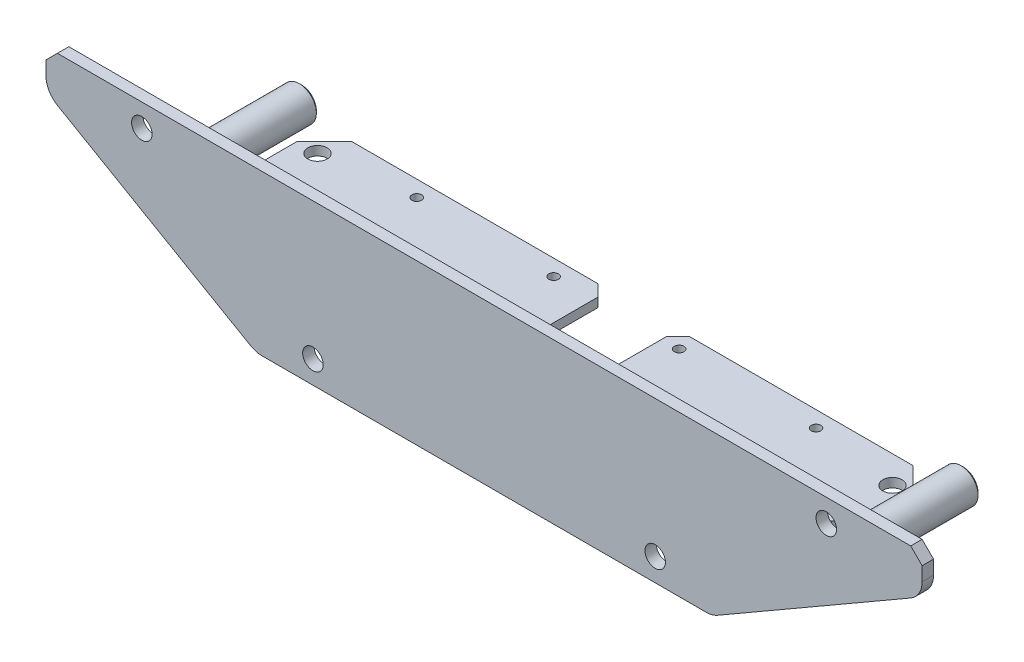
ISO-10303-21;
HEADER;
FILE_DESCRIPTION(('STEP AP214'),'2;1');
FILE_NAME('part.step','',(''),(''),'','','');
FILE_SCHEMA(('AUTOMOTIVE_DESIGN { 1 0 10303 214 1 1 1 1 }'));
ENDSEC;
DATA;
#1=APPLICATION_CONTEXT('core data for automotive mechanical design processes');
#2=APPLICATION_PROTOCOL_DEFINITION('international standard','automotive_design',2000,#1);
#3=PRODUCT_CONTEXT('',#1,'mechanical');
#4=PRODUCT('Part','Part','',(#3));
#5=PRODUCT_RELATED_PRODUCT_CATEGORY('part','',(#4));
#6=PRODUCT_DEFINITION_FORMATION('','',#4);
#7=PRODUCT_DEFINITION_CONTEXT('part definition',#1,'design');
#8=PRODUCT_DEFINITION('design','',#6,#7);
#9=PRODUCT_DEFINITION_SHAPE('','',#8);
#10=(LENGTH_UNIT() NAMED_UNIT(*) SI_UNIT(.MILLI.,.METRE.));
#11=(NAMED_UNIT(*) PLANE_ANGLE_UNIT() SI_UNIT($,.RADIAN.));
#12=(NAMED_UNIT(*) SI_UNIT($,.STERADIAN.) SOLID_ANGLE_UNIT());
#13=UNCERTAINTY_MEASURE_WITH_UNIT(LENGTH_MEASURE(1.E-05),#10,'distance_accuracy_value','');
#14=(GEOMETRIC_REPRESENTATION_CONTEXT(3) GLOBAL_UNCERTAINTY_ASSIGNED_CONTEXT((#13)) GLOBAL_UNIT_ASSIGNED_CONTEXT((#10,
#11,#12)) REPRESENTATION_CONTEXT('',''));
#15=CARTESIAN_POINT('',(0.,0.,0.));
#16=DIRECTION('',(0.,0.,1.));
#17=DIRECTION('',(1.,0.,0.));
#18=AXIS2_PLACEMENT_3D('',#15,#16,#17);
#19=CARTESIAN_POINT('',(-13.,32.,-32.));
#20=DIRECTION('',(-1.,0.,0.));
#21=DIRECTION('',(0.,-1.,0.));
#22=AXIS2_PLACEMENT_3D('',#19,#20,#21);
#23=PLANE('',#22);
#24=DIRECTION('',(0.,-1.,0.));
#25=VECTOR('',#24,1.);
#26=CARTESIAN_POINT('',(-13.,32.,0.));
#27=LINE('',#26,#25);
#28=CARTESIAN_POINT('',(-13.,32.,0.));
#29=VERTEX_POINT('',#28);
#30=CARTESIAN_POINT('',(-13.,1.99999999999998,0.));
#31=VERTEX_POINT('',#30);
#32=EDGE_CURVE('E109',#29,#31,#27,.T.);
#33=ORIENTED_EDGE('',*,*,#32,.T.);
#34=DIRECTION('',(0.,0.,1.));
#35=VECTOR('',#34,1.);
#36=CARTESIAN_POINT('',(-13.,1.99999999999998,-32.));
#37=LINE('',#36,#35);
#38=CARTESIAN_POINT('',(-13.,1.99999999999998,-32.));
#39=VERTEX_POINT('',#38);
#40=EDGE_CURVE('E12',#39,#31,#37,.T.);
#41=ORIENTED_EDGE('',*,*,#40,.F.);
#42=DIRECTION('',(0.,-1.,0.));
#43=VECTOR('',#42,1.);
#44=CARTESIAN_POINT('',(-13.,32.,-32.));
#45=LINE('',#44,#43);
#46=CARTESIAN_POINT('',(-13.,32.,-32.));
#47=VERTEX_POINT('',#46);
#48=EDGE_CURVE('E118',#47,#39,#45,.T.);
#49=ORIENTED_EDGE('',*,*,#48,.F.);
#50=DIRECTION('',(0.,0.,1.));
#51=VECTOR('',#50,1.);
#52=CARTESIAN_POINT('',(-13.,32.,-32.));
#53=LINE('',#52,#51);
#54=EDGE_CURVE('E124',#47,#29,#53,.T.);
#55=ORIENTED_EDGE('',*,*,#54,.T.);
#56=EDGE_LOOP('',(#33,#41,#49,#55));
#57=FACE_BOUND('',#56,.T.);
#58=ADVANCED_FACE('F45',(#57),#23,.F.);
#59=CARTESIAN_POINT('',(-13.,1.99999999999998,-32.));
#60=DIRECTION('',(0.,1.,0.));
#61=DIRECTION('',(0.,0.,1.));
#62=AXIS2_PLACEMENT_3D('',#59,#60,#61);
#63=PLANE('',#62);
#64=DIRECTION('',(-1.,0.,0.));
#65=VECTOR('',#64,1.);
#66=CARTESIAN_POINT('',(-13.,1.99999999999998,0.));
#67=LINE('',#66,#65);
#68=CARTESIAN_POINT('',(-23.,1.99999999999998,0.));
#69=VERTEX_POINT('',#68);
#70=EDGE_CURVE('E112',#31,#69,#67,.T.);
#71=ORIENTED_EDGE('',*,*,#70,.T.);
#72=DIRECTION('',(0.,0.,1.));
#73=VECTOR('',#72,1.);
#74=CARTESIAN_POINT('',(-23.,1.99999999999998,-32.));
#75=LINE('',#74,#73);
#76=CARTESIAN_POINT('',(-23.,1.99999999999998,-32.));
#77=VERTEX_POINT('',#76);
#78=EDGE_CURVE('E52',#77,#69,#75,.T.);
#79=ORIENTED_EDGE('',*,*,#78,.F.);
#80=DIRECTION('',(-1.,0.,0.));
#81=VECTOR('',#80,1.);
#82=CARTESIAN_POINT('',(-13.,1.99999999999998,-32.));
#83=LINE('',#82,#81);
#84=EDGE_CURVE('E120',#39,#77,#83,.T.);
#85=ORIENTED_EDGE('',*,*,#84,.F.);
#86=ORIENTED_EDGE('',*,*,#40,.T.);
#87=EDGE_LOOP('',(#71,#79,#85,#86));
#88=FACE_BOUND('',#87,.T.);
#89=ADVANCED_FACE('F145',(#88),#63,.F.);
#90=CARTESIAN_POINT('',(-23.,32.,-32.));
#91=DIRECTION('',(1.,0.,0.));
#92=DIRECTION('',(0.,1.,0.));
#93=AXIS2_PLACEMENT_3D('',#90,#91,#92);
#94=PLANE('',#93);
#95=DIRECTION('',(0.,1.,0.));
#96=VECTOR('',#95,1.);
#97=CARTESIAN_POINT('',(-23.,32.,0.));
#98=LINE('',#97,#96);
#99=CARTESIAN_POINT('',(-23.,32.,0.));
#100=VERTEX_POINT('',#99);
#101=EDGE_CURVE('E114',#69,#100,#98,.T.);
#102=ORIENTED_EDGE('',*,*,#101,.T.);
#103=DIRECTION('',(0.,0.,1.));
#104=VECTOR('',#103,1.);
#105=CARTESIAN_POINT('',(-23.,32.,-32.));
#106=LINE('',#105,#104);
#107=CARTESIAN_POINT('',(-23.,32.,-32.));
#108=VERTEX_POINT('',#107);
#109=EDGE_CURVE('E127',#108,#100,#106,.T.);
#110=ORIENTED_EDGE('',*,*,#109,.F.);
#111=DIRECTION('',(0.,1.,0.));
#112=VECTOR('',#111,1.);
#113=CARTESIAN_POINT('',(-23.,32.,-32.));
#114=LINE('',#113,#112);
#115=EDGE_CURVE('E64',#77,#108,#114,.T.);
#116=ORIENTED_EDGE('',*,*,#115,.F.);
#117=ORIENTED_EDGE('',*,*,#78,.T.);
#118=EDGE_LOOP('',(#102,#110,#116,#117));
#119=FACE_BOUND('',#118,.T.);
#120=ADVANCED_FACE('F133',(#119),#94,.F.);
#121=CARTESIAN_POINT('',(-13.,32.,-32.));
#122=DIRECTION('',(0.,-1.,0.));
#123=DIRECTION('',(0.,0.,-1.));
#124=AXIS2_PLACEMENT_3D('',#121,#122,#123);
#125=PLANE('',#124);
#126=DIRECTION('',(1.,0.,0.));
#127=VECTOR('',#126,1.);
#128=CARTESIAN_POINT('',(-13.,32.,0.));
#129=LINE('',#128,#127);
#130=EDGE_CURVE('E116',#100,#29,#129,.T.);
#131=ORIENTED_EDGE('',*,*,#130,.T.);
#132=ORIENTED_EDGE('',*,*,#54,.F.);
#133=DIRECTION('',(1.,0.,0.));
#134=VECTOR('',#133,1.);
#135=CARTESIAN_POINT('',(-13.,32.,-32.));
#136=LINE('',#135,#134);
#137=EDGE_CURVE('E59',#108,#47,#136,.T.);
#138=ORIENTED_EDGE('',*,*,#137,.F.);
#139=ORIENTED_EDGE('',*,*,#109,.T.);
#140=EDGE_LOOP('',(#131,#132,#138,#139));
#141=FACE_BOUND('',#140,.T.);
#142=ADVANCED_FACE('F140',(#141),#125,.F.);
#143=CARTESIAN_POINT('',(-13.,1.99999999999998,-32.));
#144=DIRECTION('',(0.,0.,-1.));
#145=DIRECTION('',(-1.,0.,0.));
#146=AXIS2_PLACEMENT_3D('',#143,#144,#145);
#147=PLANE('',#146);
#148=CARTESIAN_POINT('',(-18.,27.,-32.));
#149=DIRECTION('',(0.,0.,-1.));
#150=DIRECTION('',(-1.,0.,0.));
#151=AXIS2_PLACEMENT_3D('',#148,#149,#150);
#152=CIRCLE('',#151,1.65);
#153=CARTESIAN_POINT('',(-19.65,27.,-32.));
#154=VERTEX_POINT('',#153);
#155=EDGE_CURVE('E98',#154,#154,#152,.T.);
#156=ORIENTED_EDGE('',*,*,#155,.F.);
#157=EDGE_LOOP('',(#156));
#158=FACE_BOUND('',#157,.T.);
#159=CARTESIAN_POINT('',(-18.,6.99999999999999,-32.));
#160=DIRECTION('',(0.,0.,-1.));
#161=DIRECTION('',(-1.,0.,0.));
#162=AXIS2_PLACEMENT_3D('',#159,#160,#161);
#163=CIRCLE('',#162,1.65);
#164=CARTESIAN_POINT('',(-19.65,6.99999999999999,-32.));
#165=VERTEX_POINT('',#164);
#166=EDGE_CURVE('E106',#165,#165,#163,.T.);
#167=ORIENTED_EDGE('',*,*,#166,.F.);
#168=EDGE_LOOP('',(#167));
#169=FACE_BOUND('',#168,.T.);
#170=ORIENTED_EDGE('',*,*,#48,.T.);
#171=ORIENTED_EDGE('',*,*,#84,.T.);
#172=ORIENTED_EDGE('',*,*,#115,.T.);
#173=ORIENTED_EDGE('',*,*,#137,.T.);
#174=EDGE_LOOP('',(#170,#171,#172,#173));
#175=FACE_BOUND('',#174,.T.);
#176=ADVANCED_FACE('F144',(#158,#169,#175),#147,.T.);
#177=CARTESIAN_POINT('',(-13.,1.99999999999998,0.));
#178=DIRECTION('',(0.,0.,-1.));
#179=DIRECTION('',(-1.,0.,0.));
#180=AXIS2_PLACEMENT_3D('',#177,#178,#179);
#181=PLANE('',#180);
#182=ORIENTED_EDGE('',*,*,#32,.F.);
#183=ORIENTED_EDGE('',*,*,#130,.F.);
#184=ORIENTED_EDGE('',*,*,#101,.F.);
#185=ORIENTED_EDGE('',*,*,#70,.F.);
#186=EDGE_LOOP('',(#182,#183,#184,#185));
#187=FACE_BOUND('',#186,.T.);
#188=ADVANCED_FACE('F138',(#187),#181,.F.);
#189=CARTESIAN_POINT('',(-18.,6.99999999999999,-32.));
#190=DIRECTION('',(0.,0.,-1.));
#191=DIRECTION('',(-1.,0.,0.));
#192=AXIS2_PLACEMENT_3D('',#189,#190,#191);
#193=CYLINDRICAL_SURFACE('',#192,1.65);
#194=CARTESIAN_POINT('',(-18.,6.99999999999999,-21.9));
#195=DIRECTION('',(0.,0.,-1.));
#196=DIRECTION('',(-1.,0.,0.));
#197=AXIS2_PLACEMENT_3D('',#194,#195,#196);
#198=CIRCLE('',#197,1.65);
#199=CARTESIAN_POINT('',(-19.65,6.99999999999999,-21.9));
#200=VERTEX_POINT('',#199);
#201=EDGE_CURVE('E101',#200,#200,#198,.T.);
#202=ORIENTED_EDGE('',*,*,#201,.F.);
#203=EDGE_LOOP('',(#202));
#204=FACE_BOUND('',#203,.T.);
#205=ORIENTED_EDGE('',*,*,#166,.T.);
#206=EDGE_LOOP('',(#205));
#207=FACE_BOUND('',#206,.T.);
#208=ADVANCED_FACE('F160',(#204,#207),#193,.F.);
#209=CARTESIAN_POINT('',(-18.,6.99999999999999,-21.9));
#210=DIRECTION('',(0.,0.,-1.));
#211=DIRECTION('',(-1.,0.,0.));
#212=AXIS2_PLACEMENT_3D('',#209,#210,#211);
#213=CONICAL_SURFACE('',#212,1.65,1.04719755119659);
#214=CARTESIAN_POINT('',(-18.,6.99999999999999,-20.9473720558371));
#215=VERTEX_POINT('',#214);
#216=VERTEX_LOOP('',#215);
#217=FACE_BOUND('',#216,.T.);
#218=ORIENTED_EDGE('',*,*,#201,.T.);
#219=EDGE_LOOP('',(#218));
#220=FACE_BOUND('',#219,.T.);
#221=ADVANCED_FACE('F163',(#217,#220),#213,.F.);
#222=CARTESIAN_POINT('',(-18.,27.,-32.));
#223=DIRECTION('',(0.,0.,-1.));
#224=DIRECTION('',(-1.,0.,0.));
#225=AXIS2_PLACEMENT_3D('',#222,#223,#224);
#226=CYLINDRICAL_SURFACE('',#225,1.65);
#227=CARTESIAN_POINT('',(-18.,27.,-21.9));
#228=DIRECTION('',(0.,0.,-1.));
#229=DIRECTION('',(-1.,0.,0.));
#230=AXIS2_PLACEMENT_3D('',#227,#228,#229);
#231=CIRCLE('',#230,1.65);
#232=CARTESIAN_POINT('',(-19.65,27.,-21.9));
#233=VERTEX_POINT('',#232);
#234=EDGE_CURVE('E96',#233,#233,#231,.T.);
#235=ORIENTED_EDGE('',*,*,#234,.F.);
#236=EDGE_LOOP('',(#235));
#237=FACE_BOUND('',#236,.T.);
#238=ORIENTED_EDGE('',*,*,#155,.T.);
#239=EDGE_LOOP('',(#238));
#240=FACE_BOUND('',#239,.T.);
#241=ADVANCED_FACE('F92',(#237,#240),#226,.F.);
#242=CARTESIAN_POINT('',(-18.,27.,-21.9));
#243=DIRECTION('',(0.,0.,-1.));
#244=DIRECTION('',(-1.,0.,0.));
#245=AXIS2_PLACEMENT_3D('',#242,#243,#244);
#246=CONICAL_SURFACE('',#245,1.65,1.04719755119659);
#247=CARTESIAN_POINT('',(-18.,27.,-20.9473720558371));
#248=VERTEX_POINT('',#247);
#249=VERTEX_LOOP('',#248);
#250=FACE_BOUND('',#249,.T.);
#251=ORIENTED_EDGE('',*,*,#234,.T.);
#252=EDGE_LOOP('',(#251));
#253=FACE_BOUND('',#252,.T.);
#254=ADVANCED_FACE('F89',(#250,#253),#246,.F.);
#255=CLOSED_SHELL('',(#58,#89,#120,#142,#176,#188,#208,#221,#241,#254));
#256=MANIFOLD_SOLID_BREP('B2',#255);
#257=CARTESIAN_POINT('',(42.,32.,-32.));
#258=DIRECTION('',(-1.,0.,0.));
#259=DIRECTION('',(0.,0.,1.));
#260=AXIS2_PLACEMENT_3D('',#257,#258,#259);
#261=PLANE('',#260);
#262=DIRECTION('',(0.,-1.,0.));
#263=VECTOR('',#262,1.);
#264=CARTESIAN_POINT('',(42.,32.,0.));
#265=LINE('',#264,#263);
#266=CARTESIAN_POINT('',(42.,32.,0.));
#267=VERTEX_POINT('',#266);
#268=CARTESIAN_POINT('',(42.,1.99999999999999,0.));
#269=VERTEX_POINT('',#268);
#270=EDGE_CURVE('E314',#267,#269,#265,.T.);
#271=ORIENTED_EDGE('',*,*,#270,.T.);
#272=DIRECTION('',(0.,0.,1.));
#273=VECTOR('',#272,1.);
#274=CARTESIAN_POINT('',(42.,1.99999999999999,-32.));
#275=LINE('',#274,#273);
#276=CARTESIAN_POINT('',(42.,1.99999999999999,-32.));
#277=VERTEX_POINT('',#276);
#278=EDGE_CURVE('E43',#277,#269,#275,.T.);
#279=ORIENTED_EDGE('',*,*,#278,.F.);
#280=DIRECTION('',(0.,-1.,0.));
#281=VECTOR('',#280,1.);
#282=CARTESIAN_POINT('',(42.,32.,-32.));
#283=LINE('',#282,#281);
#284=CARTESIAN_POINT('',(42.,32.,-32.));
#285=VERTEX_POINT('',#284);
#286=EDGE_CURVE('E323',#285,#277,#283,.T.);
#287=ORIENTED_EDGE('',*,*,#286,.F.);
#288=DIRECTION('',(0.,0.,1.));
#289=VECTOR('',#288,1.);
#290=CARTESIAN_POINT('',(42.,32.,-32.));
#291=LINE('',#290,#289);
#292=EDGE_CURVE('E329',#285,#267,#291,.T.);
#293=ORIENTED_EDGE('',*,*,#292,.T.);
#294=EDGE_LOOP('',(#271,#279,#287,#293));
#295=FACE_BOUND('',#294,.T.);
#296=ADVANCED_FACE('F250',(#295),#261,.F.);
#297=CARTESIAN_POINT('',(42.,1.99999999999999,-32.));
#298=DIRECTION('',(0.,1.,0.));
#299=DIRECTION('',(0.,0.,1.));
#300=AXIS2_PLACEMENT_3D('',#297,#298,#299);
#301=PLANE('',#300);
#302=DIRECTION('',(-1.,0.,0.));
#303=VECTOR('',#302,1.);
#304=CARTESIAN_POINT('',(42.,1.99999999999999,0.));
#305=LINE('',#304,#303);
#306=CARTESIAN_POINT('',(32.,1.99999999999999,0.));
#307=VERTEX_POINT('',#306);
#308=EDGE_CURVE('E317',#269,#307,#305,.T.);
#309=ORIENTED_EDGE('',*,*,#308,.T.);
#310=DIRECTION('',(0.,0.,1.));
#311=VECTOR('',#310,1.);
#312=CARTESIAN_POINT('',(32.,1.99999999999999,-32.));
#313=LINE('',#312,#311);
#314=CARTESIAN_POINT('',(32.,1.99999999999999,-32.));
#315=VERTEX_POINT('',#314);
#316=EDGE_CURVE('E257',#315,#307,#313,.T.);
#317=ORIENTED_EDGE('',*,*,#316,.F.);
#318=DIRECTION('',(-1.,0.,0.));
#319=VECTOR('',#318,1.);
#320=CARTESIAN_POINT('',(42.,1.99999999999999,-32.));
#321=LINE('',#320,#319);
#322=EDGE_CURVE('E325',#277,#315,#321,.T.);
#323=ORIENTED_EDGE('',*,*,#322,.F.);
#324=ORIENTED_EDGE('',*,*,#278,.T.);
#325=EDGE_LOOP('',(#309,#317,#323,#324));
#326=FACE_BOUND('',#325,.T.);
#327=ADVANCED_FACE('F350',(#326),#301,.F.);
#328=CARTESIAN_POINT('',(32.,32.,-32.));
#329=DIRECTION('',(1.,0.,0.));
#330=DIRECTION('',(0.,1.,0.));
#331=AXIS2_PLACEMENT_3D('',#328,#329,#330);
#332=PLANE('',#331);
#333=DIRECTION('',(0.,1.,0.));
#334=VECTOR('',#333,1.);
#335=CARTESIAN_POINT('',(32.,32.,0.));
#336=LINE('',#335,#334);
#337=CARTESIAN_POINT('',(32.,32.,0.));
#338=VERTEX_POINT('',#337);
#339=EDGE_CURVE('E319',#307,#338,#336,.T.);
#340=ORIENTED_EDGE('',*,*,#339,.T.);
#341=DIRECTION('',(0.,0.,1.));
#342=VECTOR('',#341,1.);
#343=CARTESIAN_POINT('',(32.,32.,-32.));
#344=LINE('',#343,#342);
#345=CARTESIAN_POINT('',(32.,32.,-32.));
#346=VERTEX_POINT('',#345);
#347=EDGE_CURVE('E332',#346,#338,#344,.T.);
#348=ORIENTED_EDGE('',*,*,#347,.F.);
#349=DIRECTION('',(0.,1.,0.));
#350=VECTOR('',#349,1.);
#351=CARTESIAN_POINT('',(32.,32.,-32.));
#352=LINE('',#351,#350);
#353=EDGE_CURVE('E269',#315,#346,#352,.T.);
#354=ORIENTED_EDGE('',*,*,#353,.F.);
#355=ORIENTED_EDGE('',*,*,#316,.T.);
#356=EDGE_LOOP('',(#340,#348,#354,#355));
#357=FACE_BOUND('',#356,.T.);
#358=ADVANCED_FACE('F338',(#357),#332,.F.);
#359=CARTESIAN_POINT('',(42.,32.,-32.));
#360=DIRECTION('',(0.,-1.,0.));
#361=DIRECTION('',(0.,0.,-1.));
#362=AXIS2_PLACEMENT_3D('',#359,#360,#361);
#363=PLANE('',#362);
#364=DIRECTION('',(1.,0.,0.));
#365=VECTOR('',#364,1.);
#366=CARTESIAN_POINT('',(42.,32.,0.));
#367=LINE('',#366,#365);
#368=EDGE_CURVE('E321',#338,#267,#367,.T.);
#369=ORIENTED_EDGE('',*,*,#368,.T.);
#370=ORIENTED_EDGE('',*,*,#292,.F.);
#371=DIRECTION('',(1.,0.,0.));
#372=VECTOR('',#371,1.);
#373=CARTESIAN_POINT('',(42.,32.,-32.));
#374=LINE('',#373,#372);
#375=EDGE_CURVE('E264',#346,#285,#374,.T.);
#376=ORIENTED_EDGE('',*,*,#375,.F.);
#377=ORIENTED_EDGE('',*,*,#347,.T.);
#378=EDGE_LOOP('',(#369,#370,#376,#377));
#379=FACE_BOUND('',#378,.T.);
#380=ADVANCED_FACE('F345',(#379),#363,.F.);
#381=CARTESIAN_POINT('',(42.,1.99999999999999,-32.));
#382=DIRECTION('',(0.,0.,-1.));
#383=DIRECTION('',(-1.,0.,0.));
#384=AXIS2_PLACEMENT_3D('',#381,#382,#383);
#385=PLANE('',#384);
#386=CARTESIAN_POINT('',(37.,27.,-32.));
#387=DIRECTION('',(0.,0.,-1.));
#388=DIRECTION('',(-1.,0.,0.));
#389=AXIS2_PLACEMENT_3D('',#386,#387,#388);
#390=CIRCLE('',#389,1.65);
#391=CARTESIAN_POINT('',(35.35,27.,-32.));
#392=VERTEX_POINT('',#391);
#393=EDGE_CURVE('E303',#392,#392,#390,.T.);
#394=ORIENTED_EDGE('',*,*,#393,.F.);
#395=EDGE_LOOP('',(#394));
#396=FACE_BOUND('',#395,.T.);
#397=CARTESIAN_POINT('',(37.,6.99999999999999,-32.));
#398=DIRECTION('',(0.,0.,-1.));
#399=DIRECTION('',(-1.,0.,0.));
#400=AXIS2_PLACEMENT_3D('',#397,#398,#399);
#401=CIRCLE('',#400,1.65);
#402=CARTESIAN_POINT('',(35.35,6.99999999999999,-32.));
#403=VERTEX_POINT('',#402);
#404=EDGE_CURVE('E311',#403,#403,#401,.T.);
#405=ORIENTED_EDGE('',*,*,#404,.F.);
#406=EDGE_LOOP('',(#405));
#407=FACE_BOUND('',#406,.T.);
#408=ORIENTED_EDGE('',*,*,#286,.T.);
#409=ORIENTED_EDGE('',*,*,#322,.T.);
#410=ORIENTED_EDGE('',*,*,#353,.T.);
#411=ORIENTED_EDGE('',*,*,#375,.T.);
#412=EDGE_LOOP('',(#408,#409,#410,#411));
#413=FACE_BOUND('',#412,.T.);
#414=ADVANCED_FACE('F349',(#396,#407,#413),#385,.T.);
#415=CARTESIAN_POINT('',(42.,1.99999999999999,0.));
#416=DIRECTION('',(0.,0.,-1.));
#417=DIRECTION('',(-1.,0.,0.));
#418=AXIS2_PLACEMENT_3D('',#415,#416,#417);
#419=PLANE('',#418);
#420=ORIENTED_EDGE('',*,*,#270,.F.);
#421=ORIENTED_EDGE('',*,*,#368,.F.);
#422=ORIENTED_EDGE('',*,*,#339,.F.);
#423=ORIENTED_EDGE('',*,*,#308,.F.);
#424=EDGE_LOOP('',(#420,#421,#422,#423));
#425=FACE_BOUND('',#424,.T.);
#426=ADVANCED_FACE('F343',(#425),#419,.F.);
#427=CARTESIAN_POINT('',(37.,6.99999999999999,-32.));
#428=DIRECTION('',(0.,0.,-1.));
#429=DIRECTION('',(-1.,0.,0.));
#430=AXIS2_PLACEMENT_3D('',#427,#428,#429);
#431=CYLINDRICAL_SURFACE('',#430,1.65);
#432=CARTESIAN_POINT('',(37.,6.99999999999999,-21.9));
#433=DIRECTION('',(0.,0.,-1.));
#434=DIRECTION('',(-1.,0.,0.));
#435=AXIS2_PLACEMENT_3D('',#432,#433,#434);
#436=CIRCLE('',#435,1.65);
#437=CARTESIAN_POINT('',(35.35,6.99999999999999,-21.9));
#438=VERTEX_POINT('',#437);
#439=EDGE_CURVE('E306',#438,#438,#436,.T.);
#440=ORIENTED_EDGE('',*,*,#439,.F.);
#441=EDGE_LOOP('',(#440));
#442=FACE_BOUND('',#441,.T.);
#443=ORIENTED_EDGE('',*,*,#404,.T.);
#444=EDGE_LOOP('',(#443));
#445=FACE_BOUND('',#444,.T.);
#446=ADVANCED_FACE('F365',(#442,#445),#431,.F.);
#447=CARTESIAN_POINT('',(37.,6.99999999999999,-21.9));
#448=DIRECTION('',(0.,0.,-1.));
#449=DIRECTION('',(-1.,0.,0.));
#450=AXIS2_PLACEMENT_3D('',#447,#448,#449);
#451=CONICAL_SURFACE('',#450,1.65,1.0471975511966);
#452=CARTESIAN_POINT('',(37.,6.99999999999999,-20.9473720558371));
#453=VERTEX_POINT('',#452);
#454=VERTEX_LOOP('',#453);
#455=FACE_BOUND('',#454,.T.);
#456=ORIENTED_EDGE('',*,*,#439,.T.);
#457=EDGE_LOOP('',(#456));
#458=FACE_BOUND('',#457,.T.);
#459=ADVANCED_FACE('F368',(#455,#458),#451,.F.);
#460=CARTESIAN_POINT('',(37.,27.,-32.));
#461=DIRECTION('',(0.,0.,-1.));
#462=DIRECTION('',(-1.,0.,0.));
#463=AXIS2_PLACEMENT_3D('',#460,#461,#462);
#464=CYLINDRICAL_SURFACE('',#463,1.65);
#465=CARTESIAN_POINT('',(37.,27.,-21.9));
#466=DIRECTION('',(0.,0.,-1.));
#467=DIRECTION('',(-1.,0.,0.));
#468=AXIS2_PLACEMENT_3D('',#465,#466,#467);
#469=CIRCLE('',#468,1.65);
#470=CARTESIAN_POINT('',(35.35,27.,-21.9));
#471=VERTEX_POINT('',#470);
#472=EDGE_CURVE('E301',#471,#471,#469,.T.);
#473=ORIENTED_EDGE('',*,*,#472,.F.);
#474=EDGE_LOOP('',(#473));
#475=FACE_BOUND('',#474,.T.);
#476=ORIENTED_EDGE('',*,*,#393,.T.);
#477=EDGE_LOOP('',(#476));
#478=FACE_BOUND('',#477,.T.);
#479=ADVANCED_FACE('F297',(#475,#478),#464,.F.);
#480=CARTESIAN_POINT('',(37.,27.,-21.9));
#481=DIRECTION('',(0.,0.,-1.));
#482=DIRECTION('',(-1.,0.,0.));
#483=AXIS2_PLACEMENT_3D('',#480,#481,#482);
#484=CONICAL_SURFACE('',#483,1.65,1.0471975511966);
#485=CARTESIAN_POINT('',(37.,27.,-20.9473720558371));
#486=VERTEX_POINT('',#485);
#487=VERTEX_LOOP('',#486);
#488=FACE_BOUND('',#487,.T.);
#489=ORIENTED_EDGE('',*,*,#472,.T.);
#490=EDGE_LOOP('',(#489));
#491=FACE_BOUND('',#490,.T.);
#492=ADVANCED_FACE('F294',(#488,#491),#484,.F.);
#493=CLOSED_SHELL('',(#296,#327,#358,#380,#414,#426,#446,#459,#479,#492));
#494=MANIFOLD_SOLID_BREP('B6',#493);
#495=CARTESIAN_POINT('',(-145.,40.,-60.));
#496=DIRECTION('',(0.,0.,1.));
#497=DIRECTION('',(1.,0.,0.));
#498=AXIS2_PLACEMENT_3D('',#495,#496,#497);
#499=CYLINDRICAL_SURFACE('',#498,7.50000000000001);
#500=CARTESIAN_POINT('',(-145.,40.,-59.));
#501=DIRECTION('',(0.,0.,-1.));
#502=DIRECTION('',(-1.,0.,0.));
#503=AXIS2_PLACEMENT_3D('',#500,#501,#502);
#504=CIRCLE('',#503,7.50000000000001);
#505=CARTESIAN_POINT('',(-152.5,40.,-59.));
#506=VERTEX_POINT('',#505);
#507=EDGE_CURVE('E482',#506,#506,#504,.F.);
#508=ORIENTED_EDGE('',*,*,#507,.T.);
#509=EDGE_LOOP('',(#508));
#510=FACE_BOUND('',#509,.T.);
#511=CARTESIAN_POINT('',(-145.,40.,0.));
#512=DIRECTION('',(0.,0.,-1.));
#513=DIRECTION('',(-1.,0.,0.));
#514=AXIS2_PLACEMENT_3D('',#511,#512,#513);
#515=CIRCLE('',#514,7.50000000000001);
#516=CARTESIAN_POINT('',(-152.5,40.,0.));
#517=VERTEX_POINT('',#516);
#518=EDGE_CURVE('E474',#517,#517,#515,.T.);
#519=ORIENTED_EDGE('',*,*,#518,.T.);
#520=EDGE_LOOP('',(#519));
#521=FACE_BOUND('',#520,.T.);
#522=ADVANCED_FACE('F455',(#510,#521),#499,.T.);
#523=CARTESIAN_POINT('',(-145.,40.,-60.));
#524=DIRECTION('',(0.,0.,-1.));
#525=DIRECTION('',(-1.,0.,0.));
#526=AXIS2_PLACEMENT_3D('',#523,#524,#525);
#527=PLANE('',#526);
#528=CARTESIAN_POINT('',(-145.,40.,-60.));
#529=DIRECTION('',(0.,0.,-1.));
#530=DIRECTION('',(-1.,0.,0.));
#531=AXIS2_PLACEMENT_3D('',#528,#529,#530);
#532=CIRCLE('',#531,5.39999999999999);
#533=CARTESIAN_POINT('',(-150.4,40.,-60.));
#534=VERTEX_POINT('',#533);
#535=EDGE_CURVE('E248',#534,#534,#532,.F.);
#536=ORIENTED_EDGE('',*,*,#535,.T.);
#537=EDGE_LOOP('',(#536));
#538=FACE_BOUND('',#537,.T.);
#539=CARTESIAN_POINT('',(-145.,40.,-60.));
#540=DIRECTION('',(0.,0.,-1.));
#541=DIRECTION('',(-1.,0.,0.));
#542=AXIS2_PLACEMENT_3D('',#539,#540,#541);
#543=CIRCLE('',#542,6.50000000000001);
#544=CARTESIAN_POINT('',(-151.5,40.,-60.));
#545=VERTEX_POINT('',#544);
#546=EDGE_CURVE('E477',#545,#545,#543,.T.);
#547=ORIENTED_EDGE('',*,*,#546,.T.);
#548=EDGE_LOOP('',(#547));
#549=FACE_BOUND('',#548,.T.);
#550=ADVANCED_FACE('F499',(#538,#549),#527,.T.);
#551=CARTESIAN_POINT('',(-145.,40.,0.));
#552=DIRECTION('',(0.,0.,-1.));
#553=DIRECTION('',(-1.,0.,0.));
#554=AXIS2_PLACEMENT_3D('',#551,#552,#553);
#555=PLANE('',#554);
#556=ORIENTED_EDGE('',*,*,#518,.F.);
#557=EDGE_LOOP('',(#556));
#558=FACE_BOUND('',#557,.T.);
#559=ADVANCED_FACE('F504',(#558),#555,.F.);
#560=CARTESIAN_POINT('',(-145.,40.,-60.));
#561=DIRECTION('',(0.,0.,-1.));
#562=DIRECTION('',(-1.,0.,0.));
#563=AXIS2_PLACEMENT_3D('',#560,#561,#562);
#564=CYLINDRICAL_SURFACE('',#563,3.39999999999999);
#565=CARTESIAN_POINT('',(-145.,40.,-58.));
#566=DIRECTION('',(0.,0.,-1.));
#567=DIRECTION('',(-1.,0.,0.));
#568=AXIS2_PLACEMENT_3D('',#565,#566,#567);
#569=CIRCLE('',#568,3.39999999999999);
#570=CARTESIAN_POINT('',(-148.4,40.,-58.));
#571=VERTEX_POINT('',#570);
#572=EDGE_CURVE('E461',#571,#571,#569,.T.);
#573=ORIENTED_EDGE('',*,*,#572,.T.);
#574=EDGE_LOOP('',(#573));
#575=FACE_BOUND('',#574,.T.);
#576=CARTESIAN_POINT('',(-145.,40.,-40.));
#577=DIRECTION('',(0.,0.,-1.));
#578=DIRECTION('',(-1.,0.,0.));
#579=AXIS2_PLACEMENT_3D('',#576,#577,#578);
#580=CIRCLE('',#579,3.39999999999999);
#581=CARTESIAN_POINT('',(-148.4,40.,-40.));
#582=VERTEX_POINT('',#581);
#583=EDGE_CURVE('E472',#582,#582,#580,.T.);
#584=ORIENTED_EDGE('',*,*,#583,.F.);
#585=EDGE_LOOP('',(#584));
#586=FACE_BOUND('',#585,.T.);
#587=ADVANCED_FACE('F468',(#575,#586),#564,.F.);
#588=CARTESIAN_POINT('',(-145.,40.,-40.));
#589=DIRECTION('',(0.,0.,-1.));
#590=DIRECTION('',(-1.,0.,0.));
#591=AXIS2_PLACEMENT_3D('',#588,#589,#590);
#592=CONICAL_SURFACE('',#591,3.39999999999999,1.0471975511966);
#593=CARTESIAN_POINT('',(-145.,40.,-38.0370090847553));
#594=VERTEX_POINT('',#593);
#595=VERTEX_LOOP('',#594);
#596=FACE_BOUND('',#595,.T.);
#597=ORIENTED_EDGE('',*,*,#583,.T.);
#598=EDGE_LOOP('',(#597));
#599=FACE_BOUND('',#598,.T.);
#600=ADVANCED_FACE('F464',(#596,#599),#592,.F.);
#601=CARTESIAN_POINT('',(-145.,40.,-60.));
#602=DIRECTION('',(0.,0.,1.));
#603=DIRECTION('',(1.,0.,0.));
#604=AXIS2_PLACEMENT_3D('',#601,#602,#603);
#605=CONICAL_SURFACE('',#604,6.50000000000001,0.785398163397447);
#606=ORIENTED_EDGE('',*,*,#507,.F.);
#607=EDGE_LOOP('',(#606));
#608=FACE_BOUND('',#607,.T.);
#609=ORIENTED_EDGE('',*,*,#546,.F.);
#610=EDGE_LOOP('',(#609));
#611=FACE_BOUND('',#610,.T.);
#612=ADVANCED_FACE('F467',(#608,#611),#605,.T.);
#613=CARTESIAN_POINT('',(-145.,40.,-58.));
#614=DIRECTION('',(0.,0.,-1.));
#615=DIRECTION('',(-1.,0.,0.));
#616=AXIS2_PLACEMENT_3D('',#613,#614,#615);
#617=CONICAL_SURFACE('',#616,3.39999999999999,0.78539816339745);
#618=ORIENTED_EDGE('',*,*,#535,.F.);
#619=EDGE_LOOP('',(#618));
#620=FACE_BOUND('',#619,.T.);
#621=ORIENTED_EDGE('',*,*,#572,.F.);
#622=EDGE_LOOP('',(#621));
#623=FACE_BOUND('',#622,.T.);
#624=ADVANCED_FACE('F488',(#620,#623),#617,.F.);
#625=CLOSED_SHELL('',(#522,#550,#559,#587,#600,#612,#624));
#626=MANIFOLD_SOLID_BREP('B37',#625);
#627=CARTESIAN_POINT('',(145.,40.,-60.));
#628=DIRECTION('',(0.,0.,1.));
#629=DIRECTION('',(1.,0.,0.));
#630=AXIS2_PLACEMENT_3D('',#627,#628,#629);
#631=CYLINDRICAL_SURFACE('',#630,7.50000000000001);
#632=CARTESIAN_POINT('',(145.,40.,-59.));
#633=DIRECTION('',(0.,0.,-1.));
#634=DIRECTION('',(-1.,0.,0.));
#635=AXIS2_PLACEMENT_3D('',#632,#633,#634);
#636=CIRCLE('',#635,7.50000000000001);
#637=CARTESIAN_POINT('',(137.5,40.,-59.));
#638=VERTEX_POINT('',#637);
#639=EDGE_CURVE('E596',#638,#638,#636,.F.);
#640=ORIENTED_EDGE('',*,*,#639,.T.);
#641=EDGE_LOOP('',(#640));
#642=FACE_BOUND('',#641,.T.);
#643=CARTESIAN_POINT('',(145.,40.,0.));
#644=DIRECTION('',(0.,0.,-1.));
#645=DIRECTION('',(-1.,0.,0.));
#646=AXIS2_PLACEMENT_3D('',#643,#644,#645);
#647=CIRCLE('',#646,7.50000000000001);
#648=CARTESIAN_POINT('',(137.5,40.,0.));
#649=VERTEX_POINT('',#648);
#650=EDGE_CURVE('E588',#649,#649,#647,.T.);
#651=ORIENTED_EDGE('',*,*,#650,.T.);
#652=EDGE_LOOP('',(#651));
#653=FACE_BOUND('',#652,.T.);
#654=ADVANCED_FACE('F569',(#642,#653),#631,.T.);
#655=CARTESIAN_POINT('',(145.,40.,-60.));
#656=DIRECTION('',(0.,0.,-1.));
#657=DIRECTION('',(-1.,0.,0.));
#658=AXIS2_PLACEMENT_3D('',#655,#656,#657);
#659=PLANE('',#658);
#660=CARTESIAN_POINT('',(145.,40.,-60.));
#661=DIRECTION('',(0.,0.,-1.));
#662=DIRECTION('',(-1.,0.,0.));
#663=AXIS2_PLACEMENT_3D('',#660,#661,#662);
#664=CIRCLE('',#663,5.39999999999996);
#665=CARTESIAN_POINT('',(139.6,40.,-60.));
#666=VERTEX_POINT('',#665);
#667=EDGE_CURVE('E453',#666,#666,#664,.F.);
#668=ORIENTED_EDGE('',*,*,#667,.T.);
#669=EDGE_LOOP('',(#668));
#670=FACE_BOUND('',#669,.T.);
#671=CARTESIAN_POINT('',(145.,40.,-60.));
#672=DIRECTION('',(0.,0.,-1.));
#673=DIRECTION('',(-1.,0.,0.));
#674=AXIS2_PLACEMENT_3D('',#671,#672,#673);
#675=CIRCLE('',#674,6.50000000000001);
#676=CARTESIAN_POINT('',(138.5,40.,-60.));
#677=VERTEX_POINT('',#676);
#678=EDGE_CURVE('E591',#677,#677,#675,.T.);
#679=ORIENTED_EDGE('',*,*,#678,.T.);
#680=EDGE_LOOP('',(#679));
#681=FACE_BOUND('',#680,.T.);
#682=ADVANCED_FACE('F613',(#670,#681),#659,.T.);
#683=CARTESIAN_POINT('',(145.,40.,0.));
#684=DIRECTION('',(0.,0.,-1.));
#685=DIRECTION('',(-1.,0.,0.));
#686=AXIS2_PLACEMENT_3D('',#683,#684,#685);
#687=PLANE('',#686);
#688=ORIENTED_EDGE('',*,*,#650,.F.);
#689=EDGE_LOOP('',(#688));
#690=FACE_BOUND('',#689,.T.);
#691=ADVANCED_FACE('F618',(#690),#687,.F.);
#692=CARTESIAN_POINT('',(145.,40.,-60.));
#693=DIRECTION('',(0.,0.,-1.));
#694=DIRECTION('',(-1.,0.,0.));
#695=AXIS2_PLACEMENT_3D('',#692,#693,#694);
#696=CYLINDRICAL_SURFACE('',#695,3.39999999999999);
#697=CARTESIAN_POINT('',(145.,40.,-58.));
#698=DIRECTION('',(0.,0.,-1.));
#699=DIRECTION('',(-1.,0.,0.));
#700=AXIS2_PLACEMENT_3D('',#697,#698,#699);
#701=CIRCLE('',#700,3.39999999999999);
#702=CARTESIAN_POINT('',(141.6,40.,-58.));
#703=VERTEX_POINT('',#702);
#704=EDGE_CURVE('E575',#703,#703,#701,.T.);
#705=ORIENTED_EDGE('',*,*,#704,.T.);
#706=EDGE_LOOP('',(#705));
#707=FACE_BOUND('',#706,.T.);
#708=CARTESIAN_POINT('',(145.,40.,-40.));
#709=DIRECTION('',(0.,0.,-1.));
#710=DIRECTION('',(-1.,0.,0.));
#711=AXIS2_PLACEMENT_3D('',#708,#709,#710);
#712=CIRCLE('',#711,3.39999999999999);
#713=CARTESIAN_POINT('',(141.6,40.,-40.));
#714=VERTEX_POINT('',#713);
#715=EDGE_CURVE('E586',#714,#714,#712,.T.);
#716=ORIENTED_EDGE('',*,*,#715,.F.);
#717=EDGE_LOOP('',(#716));
#718=FACE_BOUND('',#717,.T.);
#719=ADVANCED_FACE('F582',(#707,#718),#696,.F.);
#720=CARTESIAN_POINT('',(145.,40.,-40.));
#721=DIRECTION('',(0.,0.,-1.));
#722=DIRECTION('',(-1.,0.,0.));
#723=AXIS2_PLACEMENT_3D('',#720,#721,#722);
#724=CONICAL_SURFACE('',#723,3.39999999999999,1.0471975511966);
#725=CARTESIAN_POINT('',(145.,40.,-38.0370090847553));
#726=VERTEX_POINT('',#725);
#727=VERTEX_LOOP('',#726);
#728=FACE_BOUND('',#727,.T.);
#729=ORIENTED_EDGE('',*,*,#715,.T.);
#730=EDGE_LOOP('',(#729));
#731=FACE_BOUND('',#730,.T.);
#732=ADVANCED_FACE('F578',(#728,#731),#724,.F.);
#733=CARTESIAN_POINT('',(145.,40.,-60.));
#734=DIRECTION('',(0.,0.,1.));
#735=DIRECTION('',(1.,0.,0.));
#736=AXIS2_PLACEMENT_3D('',#733,#734,#735);
#737=CONICAL_SURFACE('',#736,6.50000000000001,0.785398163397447);
#738=ORIENTED_EDGE('',*,*,#639,.F.);
#739=EDGE_LOOP('',(#738));
#740=FACE_BOUND('',#739,.T.);
#741=ORIENTED_EDGE('',*,*,#678,.F.);
#742=EDGE_LOOP('',(#741));
#743=FACE_BOUND('',#742,.T.);
#744=ADVANCED_FACE('F581',(#740,#743),#737,.T.);
#745=CARTESIAN_POINT('',(145.,40.,-58.));
#746=DIRECTION('',(0.,0.,-1.));
#747=DIRECTION('',(-1.,0.,0.));
#748=AXIS2_PLACEMENT_3D('',#745,#746,#747);
#749=CONICAL_SURFACE('',#748,3.39999999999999,0.785398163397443);
#750=ORIENTED_EDGE('',*,*,#667,.F.);
#751=EDGE_LOOP('',(#750));
#752=FACE_BOUND('',#751,.T.);
#753=ORIENTED_EDGE('',*,*,#704,.F.);
#754=EDGE_LOOP('',(#753));
#755=FACE_BOUND('',#754,.T.);
#756=ADVANCED_FACE('F602',(#752,#755),#749,.F.);
#757=CLOSED_SHELL('',(#654,#682,#691,#719,#732,#744,#756));
#758=MANIFOLD_SOLID_BREP('B242',#757);
#759=CARTESIAN_POINT('',(192.,53.1162247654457,5.));
#760=DIRECTION('',(-1.,0.,0.));
#761=DIRECTION('',(0.,-1.,0.));
#762=AXIS2_PLACEMENT_3D('',#759,#760,#761);
#763=PLANE('',#762);
#764=DIRECTION('',(0.,1.,0.));
#765=VECTOR('',#764,1.);
#766=CARTESIAN_POINT('',(192.,53.1162247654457,5.));
#767=LINE('',#766,#765);
#768=CARTESIAN_POINT('',(192.,58.889727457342,5.));
#769=VERTEX_POINT('',#768);
#770=CARTESIAN_POINT('',(192.,64.9999999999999,5.));
#771=VERTEX_POINT('',#770);
#772=EDGE_CURVE('E815',#769,#771,#767,.T.);
#773=ORIENTED_EDGE('',*,*,#772,.F.);
#774=DIRECTION('',(0.,0.,-1.));
#775=VECTOR('',#774,1.);
#776=CARTESIAN_POINT('',(192.,58.889727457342,5.));
#777=LINE('',#776,#775);
#778=CARTESIAN_POINT('',(192.,58.889727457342,0.));
#779=VERTEX_POINT('',#778);
#780=EDGE_CURVE('E567',#769,#779,#777,.T.);
#781=ORIENTED_EDGE('',*,*,#780,.T.);
#782=DIRECTION('',(0.,1.,0.));
#783=VECTOR('',#782,1.);
#784=CARTESIAN_POINT('',(192.,53.1162247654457,0.));
#785=LINE('',#784,#783);
#786=CARTESIAN_POINT('',(192.,64.9999999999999,0.));
#787=VERTEX_POINT('',#786);
#788=EDGE_CURVE('E799',#779,#787,#785,.T.);
#789=ORIENTED_EDGE('',*,*,#788,.T.);
#790=DIRECTION('',(0.,0.,1.));
#791=VECTOR('',#790,1.);
#792=CARTESIAN_POINT('',(192.,64.9999999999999,5.));
#793=LINE('',#792,#791);
#794=EDGE_CURVE('E779',#787,#771,#793,.T.);
#795=ORIENTED_EDGE('',*,*,#794,.T.);
#796=EDGE_LOOP('',(#773,#781,#789,#795));
#797=FACE_BOUND('',#796,.T.);
#798=ADVANCED_FACE('F682',(#797),#763,.F.);
#799=CARTESIAN_POINT('',(-192.,70.,5.));
#800=DIRECTION('',(0.,-1.,0.));
#801=DIRECTION('',(0.,0.,-1.));
#802=AXIS2_PLACEMENT_3D('',#799,#800,#801);
#803=PLANE('',#802);
#804=DIRECTION('',(-1.,0.,0.));
#805=VECTOR('',#804,1.);
#806=CARTESIAN_POINT('',(-192.,70.,5.));
#807=LINE('',#806,#805);
#808=CARTESIAN_POINT('',(187.,70.,5.));
#809=VERTEX_POINT('',#808);
#810=CARTESIAN_POINT('',(-187.,70.,5.));
#811=VERTEX_POINT('',#810);
#812=EDGE_CURVE('E792',#809,#811,#807,.T.);
#813=ORIENTED_EDGE('',*,*,#812,.F.);
#814=DIRECTION('',(0.,0.,-1.));
#815=VECTOR('',#814,1.);
#816=CARTESIAN_POINT('',(187.,70.,5.));
#817=LINE('',#816,#815);
#818=CARTESIAN_POINT('',(187.,70.,0.));
#819=VERTEX_POINT('',#818);
#820=EDGE_CURVE('E777',#809,#819,#817,.T.);
#821=ORIENTED_EDGE('',*,*,#820,.T.);
#822=DIRECTION('',(-1.,0.,0.));
#823=VECTOR('',#822,1.);
#824=CARTESIAN_POINT('',(-192.,70.,0.));
#825=LINE('',#824,#823);
#826=CARTESIAN_POINT('',(-187.,70.,0.));
#827=VERTEX_POINT('',#826);
#828=EDGE_CURVE('E789',#819,#827,#825,.T.);
#829=ORIENTED_EDGE('',*,*,#828,.T.);
#830=DIRECTION('',(0.,0.,1.));
#831=VECTOR('',#830,1.);
#832=CARTESIAN_POINT('',(-187.,70.,5.));
#833=LINE('',#832,#831);
#834=EDGE_CURVE('E793',#827,#811,#833,.T.);
#835=ORIENTED_EDGE('',*,*,#834,.T.);
#836=EDGE_LOOP('',(#813,#821,#829,#835));
#837=FACE_BOUND('',#836,.T.);
#838=ADVANCED_FACE('F788',(#837),#803,.F.);
#839=CARTESIAN_POINT('',(-192.,70.,5.));
#840=DIRECTION('',(1.,0.,0.));
#841=DIRECTION('',(0.,0.,-1.));
#842=AXIS2_PLACEMENT_3D('',#839,#840,#841);
#843=PLANE('',#842);
#844=DIRECTION('',(0.,-1.,0.));
#845=VECTOR('',#844,1.);
#846=CARTESIAN_POINT('',(-192.,70.,0.));
#847=LINE('',#846,#845);
#848=CARTESIAN_POINT('',(-192.,64.9999999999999,0.));
#849=VERTEX_POINT('',#848);
#850=CARTESIAN_POINT('',(-192.,58.889727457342,0.));
#851=VERTEX_POINT('',#850);
#852=EDGE_CURVE('E798',#849,#851,#847,.T.);
#853=ORIENTED_EDGE('',*,*,#852,.T.);
#854=DIRECTION('',(0.,0.,-1.));
#855=VECTOR('',#854,1.);
#856=CARTESIAN_POINT('',(-192.,58.889727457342,5.));
#857=LINE('',#856,#855);
#858=CARTESIAN_POINT('',(-192.,58.889727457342,5.));
#859=VERTEX_POINT('',#858);
#860=EDGE_CURVE('E851',#851,#859,#857,.F.);
#861=ORIENTED_EDGE('',*,*,#860,.T.);
#862=DIRECTION('',(0.,-1.,0.));
#863=VECTOR('',#862,1.);
#864=CARTESIAN_POINT('',(-192.,70.,5.));
#865=LINE('',#864,#863);
#866=CARTESIAN_POINT('',(-192.,65.,5.));
#867=VERTEX_POINT('',#866);
#868=EDGE_CURVE('E818',#867,#859,#865,.T.);
#869=ORIENTED_EDGE('',*,*,#868,.F.);
#870=DIRECTION('',(0.,0.,-1.));
#871=VECTOR('',#870,1.);
#872=CARTESIAN_POINT('',(-192.,65.,5.));
#873=LINE('',#872,#871);
#874=EDGE_CURVE('E835',#867,#849,#873,.T.);
#875=ORIENTED_EDGE('',*,*,#874,.T.);
#876=EDGE_LOOP('',(#853,#861,#869,#875));
#877=FACE_BOUND('',#876,.T.);
#878=ADVANCED_FACE('F884',(#877),#843,.F.);
#879=CARTESIAN_POINT('',(-192.,53.1162247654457,5.));
#880=DIRECTION('',(0.500000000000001,0.866025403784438,0.));
#881=DIRECTION('',(-0.866025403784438,0.500000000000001,0.));
#882=AXIS2_PLACEMENT_3D('',#879,#880,#881);
#883=PLANE('',#882);
#884=DIRECTION('',(0.866025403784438,-0.500000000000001,0.));
#885=VECTOR('',#884,1.);
#886=CARTESIAN_POINT('',(-192.,53.1162247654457,5.));
#887=LINE('',#886,#885);
#888=CARTESIAN_POINT('',(-187.,50.2294734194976,5.));
#889=VERTEX_POINT('',#888);
#890=CARTESIAN_POINT('',(-102.320508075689,1.33974596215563,5.));
#891=VERTEX_POINT('',#890);
#892=EDGE_CURVE('E821',#889,#891,#887,.T.);
#893=ORIENTED_EDGE('',*,*,#892,.F.);
#894=DIRECTION('',(0.,0.,-1.));
#895=VECTOR('',#894,1.);
#896=CARTESIAN_POINT('',(-187.,50.2294734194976,5.));
#897=LINE('',#896,#895);
#898=CARTESIAN_POINT('',(-187.,50.2294734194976,0.));
#899=VERTEX_POINT('',#898);
#900=EDGE_CURVE('E840',#889,#899,#897,.T.);
#901=ORIENTED_EDGE('',*,*,#900,.T.);
#902=DIRECTION('',(0.866025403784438,-0.500000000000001,0.));
#903=VECTOR('',#902,1.);
#904=CARTESIAN_POINT('',(-192.,53.1162247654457,0.));
#905=LINE('',#904,#903);
#906=CARTESIAN_POINT('',(-102.320508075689,1.33974596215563,0.));
#907=VERTEX_POINT('',#906);
#908=EDGE_CURVE('E802',#899,#907,#905,.T.);
#909=ORIENTED_EDGE('',*,*,#908,.T.);
#910=DIRECTION('',(0.,0.,-1.));
#911=VECTOR('',#910,1.);
#912=CARTESIAN_POINT('',(-102.320508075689,1.33974596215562,5.));
#913=LINE('',#912,#911);
#914=EDGE_CURVE('E838',#907,#891,#913,.F.);
#915=ORIENTED_EDGE('',*,*,#914,.T.);
#916=EDGE_LOOP('',(#893,#901,#909,#915));
#917=FACE_BOUND('',#916,.T.);
#918=ADVANCED_FACE('F892',(#917),#883,.F.);
#919=CARTESIAN_POINT('',(-100.,0.,5.));
#920=DIRECTION('',(0.,1.,0.));
#921=DIRECTION('',(0.,0.,1.));
#922=AXIS2_PLACEMENT_3D('',#919,#920,#921);
#923=PLANE('',#922);
#924=DIRECTION('',(1.,0.,0.));
#925=VECTOR('',#924,1.);
#926=CARTESIAN_POINT('',(-100.,0.,5.));
#927=LINE('',#926,#925);
#928=CARTESIAN_POINT('',(-97.3205080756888,0.,5.));
#929=VERTEX_POINT('',#928);
#930=CARTESIAN_POINT('',(97.3205080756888,0.,5.));
#931=VERTEX_POINT('',#930);
#932=EDGE_CURVE('E824',#929,#931,#927,.T.);
#933=ORIENTED_EDGE('',*,*,#932,.F.);
#934=DIRECTION('',(0.,0.,-1.));
#935=VECTOR('',#934,1.);
#936=CARTESIAN_POINT('',(-97.3205080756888,0.,5.));
#937=LINE('',#936,#935);
#938=CARTESIAN_POINT('',(-97.3205080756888,0.,0.));
#939=VERTEX_POINT('',#938);
#940=EDGE_CURVE('E862',#929,#939,#937,.T.);
#941=ORIENTED_EDGE('',*,*,#940,.T.);
#942=DIRECTION('',(1.,0.,0.));
#943=VECTOR('',#942,1.);
#944=CARTESIAN_POINT('',(-100.,0.,0.));
#945=LINE('',#944,#943);
#946=CARTESIAN_POINT('',(97.3205080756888,0.,0.));
#947=VERTEX_POINT('',#946);
#948=EDGE_CURVE('E810',#939,#947,#945,.T.);
#949=ORIENTED_EDGE('',*,*,#948,.T.);
#950=DIRECTION('',(0.,0.,-1.));
#951=VECTOR('',#950,1.);
#952=CARTESIAN_POINT('',(97.3205080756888,0.,5.));
#953=LINE('',#952,#951);
#954=EDGE_CURVE('E860',#947,#931,#953,.F.);
#955=ORIENTED_EDGE('',*,*,#954,.T.);
#956=EDGE_LOOP('',(#933,#941,#949,#955));
#957=FACE_BOUND('',#956,.T.);
#958=ADVANCED_FACE('F900',(#957),#923,.F.);
#959=CARTESIAN_POINT('',(100.,0.,5.));
#960=DIRECTION('',(-0.500000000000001,0.866025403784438,0.));
#961=DIRECTION('',(-0.866025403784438,-0.500000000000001,0.));
#962=AXIS2_PLACEMENT_3D('',#959,#960,#961);
#963=PLANE('',#962);
#964=DIRECTION('',(0.866025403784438,0.500000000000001,0.));
#965=VECTOR('',#964,1.);
#966=CARTESIAN_POINT('',(100.,0.,5.));
#967=LINE('',#966,#965);
#968=CARTESIAN_POINT('',(102.320508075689,1.33974596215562,5.));
#969=VERTEX_POINT('',#968);
#970=CARTESIAN_POINT('',(187.,50.2294734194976,5.));
#971=VERTEX_POINT('',#970);
#972=EDGE_CURVE('E826',#969,#971,#967,.T.);
#973=ORIENTED_EDGE('',*,*,#972,.F.);
#974=DIRECTION('',(0.,0.,-1.));
#975=VECTOR('',#974,1.);
#976=CARTESIAN_POINT('',(102.320508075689,1.33974596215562,5.));
#977=LINE('',#976,#975);
#978=CARTESIAN_POINT('',(102.320508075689,1.33974596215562,0.));
#979=VERTEX_POINT('',#978);
#980=EDGE_CURVE('E689',#969,#979,#977,.T.);
#981=ORIENTED_EDGE('',*,*,#980,.T.);
#982=DIRECTION('',(0.866025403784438,0.500000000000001,0.));
#983=VECTOR('',#982,1.);
#984=CARTESIAN_POINT('',(100.,0.,0.));
#985=LINE('',#984,#983);
#986=CARTESIAN_POINT('',(187.,50.2294734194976,0.));
#987=VERTEX_POINT('',#986);
#988=EDGE_CURVE('E813',#979,#987,#985,.T.);
#989=ORIENTED_EDGE('',*,*,#988,.T.);
#990=DIRECTION('',(0.,0.,-1.));
#991=VECTOR('',#990,1.);
#992=CARTESIAN_POINT('',(187.,50.2294734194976,5.));
#993=LINE('',#992,#991);
#994=EDGE_CURVE('E696',#987,#971,#993,.F.);
#995=ORIENTED_EDGE('',*,*,#994,.T.);
#996=EDGE_LOOP('',(#973,#981,#989,#995));
#997=FACE_BOUND('',#996,.T.);
#998=ADVANCED_FACE('F868',(#997),#963,.F.);
#999=CARTESIAN_POINT('',(192.,70.,5.));
#1000=DIRECTION('',(0.,0.,-1.));
#1001=DIRECTION('',(-1.,0.,0.));
#1002=AXIS2_PLACEMENT_3D('',#999,#1000,#1001);
#1003=PLANE('',#1002);
#1004=CARTESIAN_POINT('',(-75.,10.,5.));
#1005=DIRECTION('',(0.,0.,-1.));
#1006=DIRECTION('',(-1.,0.,0.));
#1007=AXIS2_PLACEMENT_3D('',#1004,#1005,#1006);
#1008=CIRCLE('',#1007,4.5);
#1009=CARTESIAN_POINT('',(-79.5,10.,5.));
#1010=VERTEX_POINT('',#1009);
#1011=EDGE_CURVE('E1058',#1010,#1010,#1008,.T.);
#1012=ORIENTED_EDGE('',*,*,#1011,.T.);
#1013=EDGE_LOOP('',(#1012));
#1014=FACE_BOUND('',#1013,.T.);
#1015=CARTESIAN_POINT('',(-150.,60.,5.));
#1016=DIRECTION('',(0.,0.,-1.));
#1017=DIRECTION('',(-1.,0.,0.));
#1018=AXIS2_PLACEMENT_3D('',#1015,#1016,#1017);
#1019=CIRCLE('',#1018,4.49999999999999);
#1020=CARTESIAN_POINT('',(-154.5,60.,5.));
#1021=VERTEX_POINT('',#1020);
#1022=EDGE_CURVE('E1068',#1021,#1021,#1019,.T.);
#1023=ORIENTED_EDGE('',*,*,#1022,.T.);
#1024=EDGE_LOOP('',(#1023));
#1025=FACE_BOUND('',#1024,.T.);
#1026=CARTESIAN_POINT('',(75.,10.,5.));
#1027=DIRECTION('',(0.,0.,-1.));
#1028=DIRECTION('',(-1.,0.,0.));
#1029=AXIS2_PLACEMENT_3D('',#1026,#1027,#1028);
#1030=CIRCLE('',#1029,4.5);
#1031=CARTESIAN_POINT('',(70.5,10.,5.));
#1032=VERTEX_POINT('',#1031);
#1033=EDGE_CURVE('E1074',#1032,#1032,#1030,.T.);
#1034=ORIENTED_EDGE('',*,*,#1033,.T.);
#1035=EDGE_LOOP('',(#1034));
#1036=FACE_BOUND('',#1035,.T.);
#1037=CARTESIAN_POINT('',(150.,60.,5.));
#1038=DIRECTION('',(0.,0.,-1.));
#1039=DIRECTION('',(-1.,0.,0.));
#1040=AXIS2_PLACEMENT_3D('',#1037,#1038,#1039);
#1041=CIRCLE('',#1040,4.49999999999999);
#1042=CARTESIAN_POINT('',(145.5,60.,5.));
#1043=VERTEX_POINT('',#1042);
#1044=EDGE_CURVE('E804',#1043,#1043,#1041,.T.);
#1045=ORIENTED_EDGE('',*,*,#1044,.T.);
#1046=EDGE_LOOP('',(#1045));
#1047=FACE_BOUND('',#1046,.T.);
#1048=ORIENTED_EDGE('',*,*,#868,.T.);
#1049=CARTESIAN_POINT('',(-182.,58.889727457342,5.));
#1050=DIRECTION('',(0.,0.,-1.));
#1051=DIRECTION('',(-1.,0.,0.));
#1052=AXIS2_PLACEMENT_3D('',#1049,#1050,#1051);
#1053=CIRCLE('',#1052,10.);
#1054=EDGE_CURVE('E858',#859,#889,#1053,.F.);
#1055=ORIENTED_EDGE('',*,*,#1054,.T.);
#1056=ORIENTED_EDGE('',*,*,#892,.T.);
#1057=CARTESIAN_POINT('',(-97.3205080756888,10.,5.));
#1058=DIRECTION('',(0.,0.,-1.));
#1059=DIRECTION('',(-1.,0.,0.));
#1060=AXIS2_PLACEMENT_3D('',#1057,#1058,#1059);
#1061=CIRCLE('',#1060,10.);
#1062=EDGE_CURVE('E856',#891,#929,#1061,.F.);
#1063=ORIENTED_EDGE('',*,*,#1062,.T.);
#1064=ORIENTED_EDGE('',*,*,#932,.T.);
#1065=CARTESIAN_POINT('',(97.3205080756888,10.,5.));
#1066=DIRECTION('',(0.,0.,-1.));
#1067=DIRECTION('',(-1.,0.,0.));
#1068=AXIS2_PLACEMENT_3D('',#1065,#1066,#1067);
#1069=CIRCLE('',#1068,10.);
#1070=EDGE_CURVE('E703',#931,#969,#1069,.F.);
#1071=ORIENTED_EDGE('',*,*,#1070,.T.);
#1072=ORIENTED_EDGE('',*,*,#972,.T.);
#1073=CARTESIAN_POINT('',(182.,58.889727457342,5.));
#1074=DIRECTION('',(0.,0.,-1.));
#1075=DIRECTION('',(-1.,0.,0.));
#1076=AXIS2_PLACEMENT_3D('',#1073,#1074,#1075);
#1077=CIRCLE('',#1076,10.);
#1078=EDGE_CURVE('E853',#971,#769,#1077,.F.);
#1079=ORIENTED_EDGE('',*,*,#1078,.T.);
#1080=ORIENTED_EDGE('',*,*,#772,.T.);
#1081=DIRECTION('',(0.70710678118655,-0.707106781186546,0.));
#1082=VECTOR('',#1081,1.);
#1083=CARTESIAN_POINT('',(187.,70.,5.));
#1084=LINE('',#1083,#1082);
#1085=EDGE_CURVE('E833',#771,#809,#1084,.F.);
#1086=ORIENTED_EDGE('',*,*,#1085,.T.);
#1087=ORIENTED_EDGE('',*,*,#812,.T.);
#1088=DIRECTION('',(0.707106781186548,0.707106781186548,0.));
#1089=VECTOR('',#1088,1.);
#1090=CARTESIAN_POINT('',(-192.,65.,5.));
#1091=LINE('',#1090,#1089);
#1092=EDGE_CURVE('E831',#811,#867,#1091,.F.);
#1093=ORIENTED_EDGE('',*,*,#1092,.T.);
#1094=EDGE_LOOP('',(#1048,#1055,#1056,#1063,#1064,#1071,#1072,#1079,#1080,#1086,#1087,#1093));
#1095=FACE_BOUND('',#1094,.T.);
#1096=ADVANCED_FACE('F877',(#1014,#1025,#1036,#1047,#1095),#1003,.F.);
#1097=CARTESIAN_POINT('',(192.,70.,0.));
#1098=DIRECTION('',(0.,0.,-1.));
#1099=DIRECTION('',(-1.,0.,0.));
#1100=AXIS2_PLACEMENT_3D('',#1097,#1098,#1099);
#1101=PLANE('',#1100);
#1102=CARTESIAN_POINT('',(-75.,10.,0.));
#1103=DIRECTION('',(0.,0.,-1.));
#1104=DIRECTION('',(-1.,0.,0.));
#1105=AXIS2_PLACEMENT_3D('',#1102,#1103,#1104);
#1106=CIRCLE('',#1105,4.5);
#1107=CARTESIAN_POINT('',(-79.5,10.,0.));
#1108=VERTEX_POINT('',#1107);
#1109=EDGE_CURVE('E1061',#1108,#1108,#1106,.T.);
#1110=ORIENTED_EDGE('',*,*,#1109,.F.);
#1111=EDGE_LOOP('',(#1110));
#1112=FACE_BOUND('',#1111,.T.);
#1113=CARTESIAN_POINT('',(-150.,60.,0.));
#1114=DIRECTION('',(0.,0.,-1.));
#1115=DIRECTION('',(-1.,0.,0.));
#1116=AXIS2_PLACEMENT_3D('',#1113,#1114,#1115);
#1117=CIRCLE('',#1116,4.49999999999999);
#1118=CARTESIAN_POINT('',(-154.5,60.,0.));
#1119=VERTEX_POINT('',#1118);
#1120=EDGE_CURVE('E1063',#1119,#1119,#1117,.T.);
#1121=ORIENTED_EDGE('',*,*,#1120,.F.);
#1122=EDGE_LOOP('',(#1121));
#1123=FACE_BOUND('',#1122,.T.);
#1124=CARTESIAN_POINT('',(75.,10.,0.));
#1125=DIRECTION('',(0.,0.,-1.));
#1126=DIRECTION('',(-1.,0.,0.));
#1127=AXIS2_PLACEMENT_3D('',#1124,#1125,#1126);
#1128=CIRCLE('',#1127,4.5);
#1129=CARTESIAN_POINT('',(70.5,10.,0.));
#1130=VERTEX_POINT('',#1129);
#1131=EDGE_CURVE('E1071',#1130,#1130,#1128,.T.);
#1132=ORIENTED_EDGE('',*,*,#1131,.F.);
#1133=EDGE_LOOP('',(#1132));
#1134=FACE_BOUND('',#1133,.T.);
#1135=CARTESIAN_POINT('',(150.,60.,0.));
#1136=DIRECTION('',(0.,0.,-1.));
#1137=DIRECTION('',(-1.,0.,0.));
#1138=AXIS2_PLACEMENT_3D('',#1135,#1136,#1137);
#1139=CIRCLE('',#1138,4.49999999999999);
#1140=CARTESIAN_POINT('',(145.5,60.,0.));
#1141=VERTEX_POINT('',#1140);
#1142=EDGE_CURVE('E1077',#1141,#1141,#1139,.T.);
#1143=ORIENTED_EDGE('',*,*,#1142,.F.);
#1144=EDGE_LOOP('',(#1143));
#1145=FACE_BOUND('',#1144,.T.);
#1146=ORIENTED_EDGE('',*,*,#908,.F.);
#1147=CARTESIAN_POINT('',(-182.,58.889727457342,0.));
#1148=DIRECTION('',(0.,0.,-1.));
#1149=DIRECTION('',(-1.,0.,0.));
#1150=AXIS2_PLACEMENT_3D('',#1147,#1148,#1149);
#1151=CIRCLE('',#1150,10.);
#1152=EDGE_CURVE('E849',#899,#851,#1151,.T.);
#1153=ORIENTED_EDGE('',*,*,#1152,.T.);
#1154=ORIENTED_EDGE('',*,*,#852,.F.);
#1155=DIRECTION('',(-0.707106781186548,-0.707106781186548,0.));
#1156=VECTOR('',#1155,1.);
#1157=CARTESIAN_POINT('',(2.5,259.5,0.));
#1158=LINE('',#1157,#1156);
#1159=EDGE_CURVE('E783',#849,#827,#1158,.F.);
#1160=ORIENTED_EDGE('',*,*,#1159,.T.);
#1161=ORIENTED_EDGE('',*,*,#828,.F.);
#1162=DIRECTION('',(-0.70710678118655,0.707106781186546,0.));
#1163=VECTOR('',#1162,1.);
#1164=CARTESIAN_POINT('',(189.5,67.4999999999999,0.));
#1165=LINE('',#1164,#1163);
#1166=EDGE_CURVE('E773',#819,#787,#1165,.F.);
#1167=ORIENTED_EDGE('',*,*,#1166,.T.);
#1168=ORIENTED_EDGE('',*,*,#788,.F.);
#1169=CARTESIAN_POINT('',(182.,58.889727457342,0.));
#1170=DIRECTION('',(0.,0.,-1.));
#1171=DIRECTION('',(-1.,0.,0.));
#1172=AXIS2_PLACEMENT_3D('',#1169,#1170,#1171);
#1173=CIRCLE('',#1172,10.);
#1174=EDGE_CURVE('E843',#779,#987,#1173,.T.);
#1175=ORIENTED_EDGE('',*,*,#1174,.T.);
#1176=ORIENTED_EDGE('',*,*,#988,.F.);
#1177=CARTESIAN_POINT('',(97.3205080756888,10.,0.));
#1178=DIRECTION('',(0.,0.,-1.));
#1179=DIRECTION('',(-1.,0.,0.));
#1180=AXIS2_PLACEMENT_3D('',#1177,#1178,#1179);
#1181=CIRCLE('',#1180,10.);
#1182=EDGE_CURVE('E845',#979,#947,#1181,.T.);
#1183=ORIENTED_EDGE('',*,*,#1182,.T.);
#1184=ORIENTED_EDGE('',*,*,#948,.F.);
#1185=CARTESIAN_POINT('',(-97.3205080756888,10.,0.));
#1186=DIRECTION('',(0.,0.,-1.));
#1187=DIRECTION('',(-1.,0.,0.));
#1188=AXIS2_PLACEMENT_3D('',#1185,#1186,#1187);
#1189=CIRCLE('',#1188,10.);
#1190=EDGE_CURVE('E847',#939,#907,#1189,.T.);
#1191=ORIENTED_EDGE('',*,*,#1190,.T.);
#1192=EDGE_LOOP('',(#1146,#1153,#1154,#1160,#1161,#1167,#1168,#1175,#1176,#1183,#1184,#1191));
#1193=FACE_BOUND('',#1192,.T.);
#1194=ADVANCED_FACE('F796',(#1112,#1123,#1134,#1145,#1193),#1101,.T.);
#1195=CARTESIAN_POINT('',(150.,60.,5.));
#1196=DIRECTION('',(0.,0.,-1.));
#1197=DIRECTION('',(-1.,0.,0.));
#1198=AXIS2_PLACEMENT_3D('',#1195,#1196,#1197);
#1199=CYLINDRICAL_SURFACE('',#1198,4.49999999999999);
#1200=ORIENTED_EDGE('',*,*,#1044,.F.);
#1201=EDGE_LOOP('',(#1200));
#1202=FACE_BOUND('',#1201,.T.);
#1203=ORIENTED_EDGE('',*,*,#1142,.T.);
#1204=EDGE_LOOP('',(#1203));
#1205=FACE_BOUND('',#1204,.T.);
#1206=ADVANCED_FACE('F931',(#1202,#1205),#1199,.F.);
#1207=CARTESIAN_POINT('',(75.,10.,5.));
#1208=DIRECTION('',(0.,0.,-1.));
#1209=DIRECTION('',(-1.,0.,0.));
#1210=AXIS2_PLACEMENT_3D('',#1207,#1208,#1209);
#1211=CYLINDRICAL_SURFACE('',#1210,4.5);
#1212=ORIENTED_EDGE('',*,*,#1033,.F.);
#1213=EDGE_LOOP('',(#1212));
#1214=FACE_BOUND('',#1213,.T.);
#1215=ORIENTED_EDGE('',*,*,#1131,.T.);
#1216=EDGE_LOOP('',(#1215));
#1217=FACE_BOUND('',#1216,.T.);
#1218=ADVANCED_FACE('F935',(#1214,#1217),#1211,.F.);
#1219=CARTESIAN_POINT('',(-150.,60.,5.));
#1220=DIRECTION('',(0.,0.,-1.));
#1221=DIRECTION('',(-1.,0.,0.));
#1222=AXIS2_PLACEMENT_3D('',#1219,#1220,#1221);
#1223=CYLINDRICAL_SURFACE('',#1222,4.49999999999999);
#1224=ORIENTED_EDGE('',*,*,#1022,.F.);
#1225=EDGE_LOOP('',(#1224));
#1226=FACE_BOUND('',#1225,.T.);
#1227=ORIENTED_EDGE('',*,*,#1120,.T.);
#1228=EDGE_LOOP('',(#1227));
#1229=FACE_BOUND('',#1228,.T.);
#1230=ADVANCED_FACE('F939',(#1226,#1229),#1223,.F.);
#1231=CARTESIAN_POINT('',(-75.,10.,5.));
#1232=DIRECTION('',(0.,0.,-1.));
#1233=DIRECTION('',(-1.,0.,0.));
#1234=AXIS2_PLACEMENT_3D('',#1231,#1232,#1233);
#1235=CYLINDRICAL_SURFACE('',#1234,4.5);
#1236=ORIENTED_EDGE('',*,*,#1011,.F.);
#1237=EDGE_LOOP('',(#1236));
#1238=FACE_BOUND('',#1237,.T.);
#1239=ORIENTED_EDGE('',*,*,#1109,.T.);
#1240=EDGE_LOOP('',(#1239));
#1241=FACE_BOUND('',#1240,.T.);
#1242=ADVANCED_FACE('F943',(#1238,#1241),#1235,.F.);
#1243=CARTESIAN_POINT('',(187.,70.,5.));
#1244=DIRECTION('',(-0.707106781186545,-0.707106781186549,0.));
#1245=DIRECTION('',(0.70710678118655,-0.707106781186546,0.));
#1246=AXIS2_PLACEMENT_3D('',#1243,#1244,#1245);
#1247=PLANE('',#1246);
#1248=ORIENTED_EDGE('',*,*,#1085,.F.);
#1249=ORIENTED_EDGE('',*,*,#794,.F.);
#1250=ORIENTED_EDGE('',*,*,#1166,.F.);
#1251=ORIENTED_EDGE('',*,*,#820,.F.);
#1252=EDGE_LOOP('',(#1248,#1249,#1250,#1251));
#1253=FACE_BOUND('',#1252,.T.);
#1254=ADVANCED_FACE('F776',(#1253),#1247,.F.);
#1255=CARTESIAN_POINT('',(-192.,65.,5.));
#1256=DIRECTION('',(0.707106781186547,-0.707106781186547,0.));
#1257=DIRECTION('',(0.707106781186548,0.707106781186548,0.));
#1258=AXIS2_PLACEMENT_3D('',#1255,#1256,#1257);
#1259=PLANE('',#1258);
#1260=ORIENTED_EDGE('',*,*,#1092,.F.);
#1261=ORIENTED_EDGE('',*,*,#834,.F.);
#1262=ORIENTED_EDGE('',*,*,#1159,.F.);
#1263=ORIENTED_EDGE('',*,*,#874,.F.);
#1264=EDGE_LOOP('',(#1260,#1261,#1262,#1263));
#1265=FACE_BOUND('',#1264,.T.);
#1266=ADVANCED_FACE('F882',(#1265),#1259,.F.);
#1267=CARTESIAN_POINT('',(-182.,58.889727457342,5.));
#1268=DIRECTION('',(0.,0.,-1.));
#1269=DIRECTION('',(-1.,0.,0.));
#1270=AXIS2_PLACEMENT_3D('',#1267,#1268,#1269);
#1271=CYLINDRICAL_SURFACE('',#1270,10.);
#1272=ORIENTED_EDGE('',*,*,#1054,.F.);
#1273=ORIENTED_EDGE('',*,*,#860,.F.);
#1274=ORIENTED_EDGE('',*,*,#1152,.F.);
#1275=ORIENTED_EDGE('',*,*,#900,.F.);
#1276=EDGE_LOOP('',(#1272,#1273,#1274,#1275));
#1277=FACE_BOUND('',#1276,.T.);
#1278=ADVANCED_FACE('F889',(#1277),#1271,.T.);
#1279=CARTESIAN_POINT('',(-97.3205080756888,10.,5.));
#1280=DIRECTION('',(0.,0.,-1.));
#1281=DIRECTION('',(-1.,0.,0.));
#1282=AXIS2_PLACEMENT_3D('',#1279,#1280,#1281);
#1283=CYLINDRICAL_SURFACE('',#1282,10.);
#1284=ORIENTED_EDGE('',*,*,#1062,.F.);
#1285=ORIENTED_EDGE('',*,*,#914,.F.);
#1286=ORIENTED_EDGE('',*,*,#1190,.F.);
#1287=ORIENTED_EDGE('',*,*,#940,.F.);
#1288=EDGE_LOOP('',(#1284,#1285,#1286,#1287));
#1289=FACE_BOUND('',#1288,.T.);
#1290=ADVANCED_FACE('F898',(#1289),#1283,.T.);
#1291=CARTESIAN_POINT('',(97.3205080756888,10.,5.));
#1292=DIRECTION('',(0.,0.,-1.));
#1293=DIRECTION('',(-1.,0.,0.));
#1294=AXIS2_PLACEMENT_3D('',#1291,#1292,#1293);
#1295=CYLINDRICAL_SURFACE('',#1294,10.);
#1296=ORIENTED_EDGE('',*,*,#1070,.F.);
#1297=ORIENTED_EDGE('',*,*,#954,.F.);
#1298=ORIENTED_EDGE('',*,*,#1182,.F.);
#1299=ORIENTED_EDGE('',*,*,#980,.F.);
#1300=EDGE_LOOP('',(#1296,#1297,#1298,#1299));
#1301=FACE_BOUND('',#1300,.T.);
#1302=ADVANCED_FACE('F902',(#1301),#1295,.T.);
#1303=CARTESIAN_POINT('',(182.,58.889727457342,5.));
#1304=DIRECTION('',(0.,0.,-1.));
#1305=DIRECTION('',(-1.,0.,0.));
#1306=AXIS2_PLACEMENT_3D('',#1303,#1304,#1305);
#1307=CYLINDRICAL_SURFACE('',#1306,10.);
#1308=ORIENTED_EDGE('',*,*,#1078,.F.);
#1309=ORIENTED_EDGE('',*,*,#994,.F.);
#1310=ORIENTED_EDGE('',*,*,#1174,.F.);
#1311=ORIENTED_EDGE('',*,*,#780,.F.);
#1312=EDGE_LOOP('',(#1308,#1309,#1310,#1311));
#1313=FACE_BOUND('',#1312,.T.);
#1314=ADVANCED_FACE('F874',(#1313),#1307,.T.);
#1315=CLOSED_SHELL('',(#798,#838,#878,#918,#958,#998,#1096,#1194,#1206,#1218,#1230,#1242,#1254,
#1266,#1278,#1290,#1302,#1314));
#1316=MANIFOLD_SOLID_BREP('B447',#1315);
#1317=CARTESIAN_POINT('',(-135.,36.,-60.));
#1318=DIRECTION('',(0.,0.,1.));
#1319=DIRECTION('',(1.,0.,0.));
#1320=AXIS2_PLACEMENT_3D('',#1317,#1318,#1319);
#1321=PLANE('',#1320);
#1322=DIRECTION('',(1.,0.,0.));
#1323=VECTOR('',#1322,1.);
#1324=CARTESIAN_POINT('',(135.,32.,-60.));
#1325=LINE('',#1324,#1323);
#1326=CARTESIAN_POINT('',(24.9999999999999,32.,-60.));
#1327=VERTEX_POINT('',#1326);
#1328=CARTESIAN_POINT('',(123.,32.,-60.));
#1329=VERTEX_POINT('',#1328);
#1330=EDGE_CURVE('E1293',#1327,#1329,#1325,.T.);
#1331=ORIENTED_EDGE('',*,*,#1330,.F.);
#1332=DIRECTION('',(0.,1.,0.));
#1333=VECTOR('',#1332,1.);
#1334=CARTESIAN_POINT('',(24.9999999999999,36.,-60.));
#1335=LINE('',#1334,#1333);
#1336=CARTESIAN_POINT('',(24.9999999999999,36.,-60.));
#1337=VERTEX_POINT('',#1336);
#1338=EDGE_CURVE('E1105',#1327,#1337,#1335,.T.);
#1339=ORIENTED_EDGE('',*,*,#1338,.T.);
#1340=DIRECTION('',(-1.,0.,0.));
#1341=VECTOR('',#1340,1.);
#1342=CARTESIAN_POINT('',(135.,36.,-60.));
#1343=LINE('',#1342,#1341);
#1344=CARTESIAN_POINT('',(123.,36.,-60.));
#1345=VERTEX_POINT('',#1344);
#1346=EDGE_CURVE('E1298',#1345,#1337,#1343,.T.);
#1347=ORIENTED_EDGE('',*,*,#1346,.F.);
#1348=DIRECTION('',(0.,-1.,0.));
#1349=VECTOR('',#1348,1.);
#1350=CARTESIAN_POINT('',(123.,32.,-60.));
#1351=LINE('',#1350,#1349);
#1352=EDGE_CURVE('E1336',#1345,#1329,#1351,.T.);
#1353=ORIENTED_EDGE('',*,*,#1352,.T.);
#1354=EDGE_LOOP('',(#1331,#1339,#1347,#1353));
#1355=FACE_BOUND('',#1354,.T.);
#1356=ADVANCED_FACE('F1097',(#1355),#1321,.F.);
#1357=CARTESIAN_POINT('',(135.,36.,-60.));
#1358=DIRECTION('',(0.,1.,0.));
#1359=DIRECTION('',(-1.,0.,0.));
#1360=AXIS2_PLACEMENT_3D('',#1357,#1358,#1359);
#1361=PLANE('',#1360);
#1362=DIRECTION('',(0.,0.,1.));
#1363=VECTOR('',#1362,1.);
#1364=CARTESIAN_POINT('',(-10.,36.,-60.));
#1365=LINE('',#1364,#1363);
#1366=CARTESIAN_POINT('',(-10.,36.,-55.));
#1367=VERTEX_POINT('',#1366);
#1368=CARTESIAN_POINT('',(-10.,36.,-25.));
#1369=VERTEX_POINT('',#1368);
#1370=EDGE_CURVE('E1198',#1367,#1369,#1365,.T.);
#1371=ORIENTED_EDGE('',*,*,#1370,.F.);
#1372=DIRECTION('',(0.707106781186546,0.,0.707106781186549));
#1373=VECTOR('',#1372,1.);
#1374=CARTESIAN_POINT('',(59.9999999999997,36.,15.));
#1375=LINE('',#1374,#1373);
#1376=CARTESIAN_POINT('',(-15.,36.,-60.));
#1377=VERTEX_POINT('',#1376);
#1378=EDGE_CURVE('E1365',#1367,#1377,#1375,.F.);
#1379=ORIENTED_EDGE('',*,*,#1378,.T.);
#1380=CARTESIAN_POINT('',(-123.,36.,-60.));
#1381=VERTEX_POINT('',#1380);
#1382=EDGE_CURVE('E1297',#1377,#1381,#1343,.T.);
#1383=ORIENTED_EDGE('',*,*,#1382,.T.);
#1384=DIRECTION('',(-0.707106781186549,0.,0.707106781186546));
#1385=VECTOR('',#1384,1.);
#1386=CARTESIAN_POINT('',(6.00000000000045,36.,-189.));
#1387=LINE('',#1386,#1385);
#1388=CARTESIAN_POINT('',(-135.,36.,-48.));
#1389=VERTEX_POINT('',#1388);
#1390=EDGE_CURVE('E1344',#1381,#1389,#1387,.T.);
#1391=ORIENTED_EDGE('',*,*,#1390,.T.);
#1392=DIRECTION('',(0.,0.,1.));
#1393=VECTOR('',#1392,1.);
#1394=CARTESIAN_POINT('',(-135.,36.,-60.));
#1395=LINE('',#1394,#1393);
#1396=CARTESIAN_POINT('',(-135.,36.,-30.));
#1397=VERTEX_POINT('',#1396);
#1398=EDGE_CURVE('E1301',#1389,#1397,#1395,.T.);
#1399=ORIENTED_EDGE('',*,*,#1398,.T.);
#1400=DIRECTION('',(-0.707106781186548,0.,-0.707106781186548));
#1401=VECTOR('',#1400,1.);
#1402=CARTESIAN_POINT('',(-15.,36.,90.));
#1403=LINE('',#1402,#1401);
#1404=CARTESIAN_POINT('',(-105.,36.,0.));
#1405=VERTEX_POINT('',#1404);
#1406=EDGE_CURVE('E1234',#1405,#1397,#1403,.T.);
#1407=ORIENTED_EDGE('',*,*,#1406,.F.);
#1408=DIRECTION('',(-1.,0.,0.));
#1409=VECTOR('',#1408,1.);
#1410=CARTESIAN_POINT('',(135.,36.,0.));
#1411=LINE('',#1410,#1409);
#1412=CARTESIAN_POINT('',(105.,36.,0.));
#1413=VERTEX_POINT('',#1412);
#1414=EDGE_CURVE('E1290',#1413,#1405,#1411,.T.);
#1415=ORIENTED_EDGE('',*,*,#1414,.F.);
#1416=DIRECTION('',(0.707106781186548,0.,-0.707106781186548));
#1417=VECTOR('',#1416,1.);
#1418=CARTESIAN_POINT('',(150.,36.,-45.));
#1419=LINE('',#1418,#1417);
#1420=CARTESIAN_POINT('',(135.,36.,-30.));
#1421=VERTEX_POINT('',#1420);
#1422=EDGE_CURVE('E1243',#1413,#1421,#1419,.T.);
#1423=ORIENTED_EDGE('',*,*,#1422,.T.);
#1424=DIRECTION('',(0.,0.,1.));
#1425=VECTOR('',#1424,1.);
#1426=CARTESIAN_POINT('',(135.,36.,-60.));
#1427=LINE('',#1426,#1425);
#1428=CARTESIAN_POINT('',(135.,36.,-48.));
#1429=VERTEX_POINT('',#1428);
#1430=EDGE_CURVE('E1305',#1429,#1421,#1427,.T.);
#1431=ORIENTED_EDGE('',*,*,#1430,.F.);
#1432=DIRECTION('',(-0.707106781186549,0.,-0.707106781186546));
#1433=VECTOR('',#1432,1.);
#1434=CARTESIAN_POINT('',(129.,36.,-54.));
#1435=LINE('',#1434,#1433);
#1436=EDGE_CURVE('E1342',#1429,#1345,#1435,.T.);
#1437=ORIENTED_EDGE('',*,*,#1436,.T.);
#1438=ORIENTED_EDGE('',*,*,#1346,.T.);
#1439=DIRECTION('',(0.707106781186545,0.,-0.70710678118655));
#1440=VECTOR('',#1439,1.);
#1441=CARTESIAN_POINT('',(79.9999999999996,36.,-115.));
#1442=LINE('',#1441,#1440);
#1443=CARTESIAN_POINT('',(20.,36.,-55.));
#1444=VERTEX_POINT('',#1443);
#1445=EDGE_CURVE('E1112',#1337,#1444,#1442,.F.);
#1446=ORIENTED_EDGE('',*,*,#1445,.T.);
#1447=DIRECTION('',(0.,0.,-1.));
#1448=VECTOR('',#1447,1.);
#1449=CARTESIAN_POINT('',(20.,36.,-60.));
#1450=LINE('',#1449,#1448);
#1451=CARTESIAN_POINT('',(20.,36.,-25.));
#1452=VERTEX_POINT('',#1451);
#1453=EDGE_CURVE('E1217',#1452,#1444,#1450,.T.);
#1454=ORIENTED_EDGE('',*,*,#1453,.F.);
#1455=CARTESIAN_POINT('',(5.,36.,-25.));
#1456=DIRECTION('',(0.,1.,0.));
#1457=DIRECTION('',(1.,0.,0.));
#1458=AXIS2_PLACEMENT_3D('',#1455,#1456,#1457);
#1459=CIRCLE('',#1458,15.);
#1460=EDGE_CURVE('E1208',#1369,#1452,#1459,.T.);
#1461=ORIENTED_EDGE('',*,*,#1460,.F.);
#1462=EDGE_LOOP('',(#1371,#1379,#1383,#1391,#1399,#1407,#1415,#1423,#1431,#1437,#1438,#1446,
#1454,#1461));
#1463=FACE_BOUND('',#1462,.T.);
#1464=CARTESIAN_POINT('',(-126.,36.,-48.));
#1465=DIRECTION('',(0.,1.,0.));
#1466=DIRECTION('',(-1.,0.,0.));
#1467=AXIS2_PLACEMENT_3D('',#1464,#1465,#1466);
#1468=CIRCLE('',#1467,4.25000000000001);
#1469=CARTESIAN_POINT('',(-130.25,36.,-48.));
#1470=VERTEX_POINT('',#1469);
#1471=EDGE_CURVE('E1284',#1470,#1470,#1468,.T.);
#1472=ORIENTED_EDGE('',*,*,#1471,.F.);
#1473=EDGE_LOOP('',(#1472));
#1474=FACE_BOUND('',#1473,.T.);
#1475=CARTESIAN_POINT('',(126.,36.,-48.));
#1476=DIRECTION('',(0.,1.,0.));
#1477=DIRECTION('',(-1.,0.,0.));
#1478=AXIS2_PLACEMENT_3D('',#1475,#1476,#1477);
#1479=CIRCLE('',#1478,4.25000000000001);
#1480=CARTESIAN_POINT('',(121.75,36.,-48.));
#1481=VERTEX_POINT('',#1480);
#1482=EDGE_CURVE('E1280',#1481,#1481,#1479,.T.);
#1483=ORIENTED_EDGE('',*,*,#1482,.F.);
#1484=EDGE_LOOP('',(#1483));
#1485=FACE_BOUND('',#1484,.T.);
#1486=CARTESIAN_POINT('',(-87.5,36.,-53.));
#1487=DIRECTION('',(0.,1.,0.));
#1488=DIRECTION('',(0.,0.,1.));
#1489=AXIS2_PLACEMENT_3D('',#1486,#1487,#1488);
#1490=CIRCLE('',#1489,2.09999999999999);
#1491=CARTESIAN_POINT('',(-87.5,36.,-50.9));
#1492=VERTEX_POINT('',#1491);
#1493=EDGE_CURVE('E1274',#1492,#1492,#1490,.T.);
#1494=ORIENTED_EDGE('',*,*,#1493,.F.);
#1495=EDGE_LOOP('',(#1494));
#1496=FACE_BOUND('',#1495,.T.);
#1497=CARTESIAN_POINT('',(87.5,36.,-53.));
#1498=DIRECTION('',(0.,1.,0.));
#1499=DIRECTION('',(0.,0.,1.));
#1500=AXIS2_PLACEMENT_3D('',#1497,#1498,#1499);
#1501=CIRCLE('',#1500,2.09999999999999);
#1502=CARTESIAN_POINT('',(87.5,36.,-50.9));
#1503=VERTEX_POINT('',#1502);
#1504=EDGE_CURVE('E1270',#1503,#1503,#1501,.T.);
#1505=ORIENTED_EDGE('',*,*,#1504,.F.);
#1506=EDGE_LOOP('',(#1505));
#1507=FACE_BOUND('',#1506,.T.);
#1508=CARTESIAN_POINT('',(-87.5,36.,-23.));
#1509=DIRECTION('',(0.,1.,0.));
#1510=DIRECTION('',(0.,0.,1.));
#1511=AXIS2_PLACEMENT_3D('',#1508,#1509,#1510);
#1512=CIRCLE('',#1511,2.09999999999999);
#1513=CARTESIAN_POINT('',(-87.5,36.,-20.9));
#1514=VERTEX_POINT('',#1513);
#1515=EDGE_CURVE('E1266',#1514,#1514,#1512,.T.);
#1516=ORIENTED_EDGE('',*,*,#1515,.F.);
#1517=EDGE_LOOP('',(#1516));
#1518=FACE_BOUND('',#1517,.T.);
#1519=CARTESIAN_POINT('',(-27.5,36.,-53.));
#1520=DIRECTION('',(0.,1.,0.));
#1521=DIRECTION('',(0.,0.,1.));
#1522=AXIS2_PLACEMENT_3D('',#1519,#1520,#1521);
#1523=CIRCLE('',#1522,2.09999999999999);
#1524=CARTESIAN_POINT('',(-27.5,36.,-50.9));
#1525=VERTEX_POINT('',#1524);
#1526=EDGE_CURVE('E1262',#1525,#1525,#1523,.T.);
#1527=ORIENTED_EDGE('',*,*,#1526,.F.);
#1528=EDGE_LOOP('',(#1527));
#1529=FACE_BOUND('',#1528,.T.);
#1530=CARTESIAN_POINT('',(-27.5,36.,-23.));
#1531=DIRECTION('',(0.,1.,0.));
#1532=DIRECTION('',(0.,0.,1.));
#1533=AXIS2_PLACEMENT_3D('',#1530,#1531,#1532);
#1534=CIRCLE('',#1533,2.09999999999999);
#1535=CARTESIAN_POINT('',(-27.5,36.,-20.9));
#1536=VERTEX_POINT('',#1535);
#1537=EDGE_CURVE('E1258',#1536,#1536,#1534,.T.);
#1538=ORIENTED_EDGE('',*,*,#1537,.F.);
#1539=EDGE_LOOP('',(#1538));
#1540=FACE_BOUND('',#1539,.T.);
#1541=CARTESIAN_POINT('',(87.5,36.,-23.));
#1542=DIRECTION('',(0.,1.,0.));
#1543=DIRECTION('',(0.,0.,1.));
#1544=AXIS2_PLACEMENT_3D('',#1541,#1542,#1543);
#1545=CIRCLE('',#1544,2.09999999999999);
#1546=CARTESIAN_POINT('',(87.5,36.,-20.9));
#1547=VERTEX_POINT('',#1546);
#1548=EDGE_CURVE('E1254',#1547,#1547,#1545,.T.);
#1549=ORIENTED_EDGE('',*,*,#1548,.F.);
#1550=EDGE_LOOP('',(#1549));
#1551=FACE_BOUND('',#1550,.T.);
#1552=CARTESIAN_POINT('',(27.5,36.,-23.));
#1553=DIRECTION('',(0.,1.,0.));
#1554=DIRECTION('',(0.,0.,1.));
#1555=AXIS2_PLACEMENT_3D('',#1552,#1553,#1554);
#1556=CIRCLE('',#1555,2.09999999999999);
#1557=CARTESIAN_POINT('',(27.5,36.,-20.9));
#1558=VERTEX_POINT('',#1557);
#1559=EDGE_CURVE('E1250',#1558,#1558,#1556,.T.);
#1560=ORIENTED_EDGE('',*,*,#1559,.F.);
#1561=EDGE_LOOP('',(#1560));
#1562=FACE_BOUND('',#1561,.T.);
#1563=CARTESIAN_POINT('',(27.5,36.,-53.));
#1564=DIRECTION('',(0.,1.,0.));
#1565=DIRECTION('',(0.,0.,1.));
#1566=AXIS2_PLACEMENT_3D('',#1563,#1564,#1565);
#1567=CIRCLE('',#1566,2.09999999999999);
#1568=CARTESIAN_POINT('',(27.5,36.,-50.9));
#1569=VERTEX_POINT('',#1568);
#1570=EDGE_CURVE('E1246',#1569,#1569,#1567,.T.);
#1571=ORIENTED_EDGE('',*,*,#1570,.F.);
#1572=EDGE_LOOP('',(#1571));
#1573=FACE_BOUND('',#1572,.T.);
#1574=ADVANCED_FACE('F1219',(#1463,#1474,#1485,#1496,#1507,#1518,#1529,#1540,#1551,#1562,#1573),
#1361,.T.);
#1575=CARTESIAN_POINT('',(135.,32.,-60.));
#1576=DIRECTION('',(1.,0.,0.));
#1577=DIRECTION('',(0.,0.,-1.));
#1578=AXIS2_PLACEMENT_3D('',#1575,#1576,#1577);
#1579=PLANE('',#1578);
#1580=ORIENTED_EDGE('',*,*,#1430,.T.);
#1581=DIRECTION('',(0.,-1.,0.));
#1582=VECTOR('',#1581,1.);
#1583=CARTESIAN_POINT('',(135.,573.128964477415,-30.));
#1584=LINE('',#1583,#1582);
#1585=CARTESIAN_POINT('',(135.,32.,-30.));
#1586=VERTEX_POINT('',#1585);
#1587=EDGE_CURVE('E1237',#1421,#1586,#1584,.T.);
#1588=ORIENTED_EDGE('',*,*,#1587,.T.);
#1589=DIRECTION('',(0.,0.,1.));
#1590=VECTOR('',#1589,1.);
#1591=CARTESIAN_POINT('',(135.,32.,-60.));
#1592=LINE('',#1591,#1590);
#1593=CARTESIAN_POINT('',(135.,32.,-48.));
#1594=VERTEX_POINT('',#1593);
#1595=EDGE_CURVE('E1308',#1594,#1586,#1592,.T.);
#1596=ORIENTED_EDGE('',*,*,#1595,.F.);
#1597=DIRECTION('',(0.,1.,0.));
#1598=VECTOR('',#1597,1.);
#1599=CARTESIAN_POINT('',(135.,36.,-48.));
#1600=LINE('',#1599,#1598);
#1601=EDGE_CURVE('E1346',#1594,#1429,#1600,.T.);
#1602=ORIENTED_EDGE('',*,*,#1601,.T.);
#1603=EDGE_LOOP('',(#1580,#1588,#1596,#1602));
#1604=FACE_BOUND('',#1603,.T.);
#1605=ADVANCED_FACE('F1378',(#1604),#1579,.T.);
#1606=CARTESIAN_POINT('',(135.,32.,-60.));
#1607=DIRECTION('',(0.,-1.,0.));
#1608=DIRECTION('',(1.,0.,0.));
#1609=AXIS2_PLACEMENT_3D('',#1606,#1607,#1608);
#1610=PLANE('',#1609);
#1611=CARTESIAN_POINT('',(-123.,32.,-60.));
#1612=VERTEX_POINT('',#1611);
#1613=CARTESIAN_POINT('',(-15.,32.,-60.));
#1614=VERTEX_POINT('',#1613);
#1615=EDGE_CURVE('E1294',#1612,#1614,#1325,.T.);
#1616=ORIENTED_EDGE('',*,*,#1615,.T.);
#1617=DIRECTION('',(-0.707106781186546,0.,-0.707106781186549));
#1618=VECTOR('',#1617,1.);
#1619=CARTESIAN_POINT('',(59.9999999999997,32.,15.));
#1620=LINE('',#1619,#1618);
#1621=CARTESIAN_POINT('',(-10.,32.,-55.));
#1622=VERTEX_POINT('',#1621);
#1623=EDGE_CURVE('E1361',#1614,#1622,#1620,.F.);
#1624=ORIENTED_EDGE('',*,*,#1623,.T.);
#1625=DIRECTION('',(0.,0.,-1.));
#1626=VECTOR('',#1625,1.);
#1627=CARTESIAN_POINT('',(-10.,32.,-60.));
#1628=LINE('',#1627,#1626);
#1629=CARTESIAN_POINT('',(-10.,32.,-25.));
#1630=VERTEX_POINT('',#1629);
#1631=EDGE_CURVE('E1224',#1630,#1622,#1628,.T.);
#1632=ORIENTED_EDGE('',*,*,#1631,.F.);
#1633=CARTESIAN_POINT('',(5.,32.,-25.));
#1634=DIRECTION('',(0.,-1.,0.));
#1635=DIRECTION('',(1.,0.,0.));
#1636=AXIS2_PLACEMENT_3D('',#1633,#1634,#1635);
#1637=CIRCLE('',#1636,15.);
#1638=CARTESIAN_POINT('',(20.,32.,-25.));
#1639=VERTEX_POINT('',#1638);
#1640=EDGE_CURVE('E1215',#1639,#1630,#1637,.T.);
#1641=ORIENTED_EDGE('',*,*,#1640,.F.);
#1642=DIRECTION('',(0.,0.,1.));
#1643=VECTOR('',#1642,1.);
#1644=CARTESIAN_POINT('',(20.,32.,-60.));
#1645=LINE('',#1644,#1643);
#1646=CARTESIAN_POINT('',(20.,32.,-55.));
#1647=VERTEX_POINT('',#1646);
#1648=EDGE_CURVE('E1227',#1647,#1639,#1645,.T.);
#1649=ORIENTED_EDGE('',*,*,#1648,.F.);
#1650=DIRECTION('',(-0.707106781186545,0.,0.70710678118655));
#1651=VECTOR('',#1650,1.);
#1652=CARTESIAN_POINT('',(79.9999999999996,32.,-115.));
#1653=LINE('',#1652,#1651);
#1654=EDGE_CURVE('E1359',#1647,#1327,#1653,.F.);
#1655=ORIENTED_EDGE('',*,*,#1654,.T.);
#1656=ORIENTED_EDGE('',*,*,#1330,.T.);
#1657=DIRECTION('',(0.707106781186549,0.,0.707106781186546));
#1658=VECTOR('',#1657,1.);
#1659=CARTESIAN_POINT('',(129.,32.,-54.));
#1660=LINE('',#1659,#1658);
#1661=EDGE_CURVE('E1332',#1329,#1594,#1660,.T.);
#1662=ORIENTED_EDGE('',*,*,#1661,.T.);
#1663=ORIENTED_EDGE('',*,*,#1595,.T.);
#1664=DIRECTION('',(-0.707106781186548,0.,0.707106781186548));
#1665=VECTOR('',#1664,1.);
#1666=CARTESIAN_POINT('',(150.,32.,-45.));
#1667=LINE('',#1666,#1665);
#1668=CARTESIAN_POINT('',(105.,32.,0.));
#1669=VERTEX_POINT('',#1668);
#1670=EDGE_CURVE('E1240',#1586,#1669,#1667,.T.);
#1671=ORIENTED_EDGE('',*,*,#1670,.T.);
#1672=DIRECTION('',(1.,0.,0.));
#1673=VECTOR('',#1672,1.);
#1674=CARTESIAN_POINT('',(135.,32.,0.));
#1675=LINE('',#1674,#1673);
#1676=CARTESIAN_POINT('',(-105.,32.,0.));
#1677=VERTEX_POINT('',#1676);
#1678=EDGE_CURVE('E1288',#1677,#1669,#1675,.T.);
#1679=ORIENTED_EDGE('',*,*,#1678,.F.);
#1680=DIRECTION('',(0.707106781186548,0.,0.707106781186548));
#1681=VECTOR('',#1680,1.);
#1682=CARTESIAN_POINT('',(-15.,32.,90.));
#1683=LINE('',#1682,#1681);
#1684=CARTESIAN_POINT('',(-135.,32.,-30.));
#1685=VERTEX_POINT('',#1684);
#1686=EDGE_CURVE('E1231',#1685,#1677,#1683,.T.);
#1687=ORIENTED_EDGE('',*,*,#1686,.F.);
#1688=DIRECTION('',(0.,0.,1.));
#1689=VECTOR('',#1688,1.);
#1690=CARTESIAN_POINT('',(-135.,32.,-60.));
#1691=LINE('',#1690,#1689);
#1692=CARTESIAN_POINT('',(-135.,32.,-48.));
#1693=VERTEX_POINT('',#1692);
#1694=EDGE_CURVE('E1300',#1693,#1685,#1691,.T.);
#1695=ORIENTED_EDGE('',*,*,#1694,.F.);
#1696=DIRECTION('',(0.707106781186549,0.,-0.707106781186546));
#1697=VECTOR('',#1696,1.);
#1698=CARTESIAN_POINT('',(6.00000000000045,32.,-189.));
#1699=LINE('',#1698,#1697);
#1700=EDGE_CURVE('E1334',#1693,#1612,#1699,.T.);
#1701=ORIENTED_EDGE('',*,*,#1700,.T.);
#1702=EDGE_LOOP('',(#1616,#1624,#1632,#1641,#1649,#1655,#1656,#1662,#1663,#1671,#1679,#1687,
#1695,#1701));
#1703=FACE_BOUND('',#1702,.T.);
#1704=CARTESIAN_POINT('',(-126.,32.,-48.));
#1705=DIRECTION('',(0.,-1.,0.));
#1706=DIRECTION('',(1.,0.,0.));
#1707=AXIS2_PLACEMENT_3D('',#1704,#1705,#1706);
#1708=CIRCLE('',#1707,4.25000000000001);
#1709=CARTESIAN_POINT('',(-121.75,32.,-48.));
#1710=VERTEX_POINT('',#1709);
#1711=EDGE_CURVE('E1287',#1710,#1710,#1708,.T.);
#1712=ORIENTED_EDGE('',*,*,#1711,.F.);
#1713=EDGE_LOOP('',(#1712));
#1714=FACE_BOUND('',#1713,.T.);
#1715=CARTESIAN_POINT('',(126.,32.,-48.));
#1716=DIRECTION('',(0.,-1.,0.));
#1717=DIRECTION('',(1.,0.,0.));
#1718=AXIS2_PLACEMENT_3D('',#1715,#1716,#1717);
#1719=CIRCLE('',#1718,4.25000000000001);
#1720=CARTESIAN_POINT('',(130.25,32.,-48.));
#1721=VERTEX_POINT('',#1720);
#1722=EDGE_CURVE('E1283',#1721,#1721,#1719,.T.);
#1723=ORIENTED_EDGE('',*,*,#1722,.F.);
#1724=EDGE_LOOP('',(#1723));
#1725=FACE_BOUND('',#1724,.T.);
#1726=CARTESIAN_POINT('',(-87.5,32.,-53.));
#1727=DIRECTION('',(0.,-1.,0.));
#1728=DIRECTION('',(1.,0.,0.));
#1729=AXIS2_PLACEMENT_3D('',#1726,#1727,#1728);
#1730=CIRCLE('',#1729,2.09999999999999);
#1731=CARTESIAN_POINT('',(-85.4,32.,-53.));
#1732=VERTEX_POINT('',#1731);
#1733=EDGE_CURVE('E1277',#1732,#1732,#1730,.T.);
#1734=ORIENTED_EDGE('',*,*,#1733,.F.);
#1735=EDGE_LOOP('',(#1734));
#1736=FACE_BOUND('',#1735,.T.);
#1737=CARTESIAN_POINT('',(87.5,32.,-53.));
#1738=DIRECTION('',(0.,-1.,0.));
#1739=DIRECTION('',(1.,0.,0.));
#1740=AXIS2_PLACEMENT_3D('',#1737,#1738,#1739);
#1741=CIRCLE('',#1740,2.09999999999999);
#1742=CARTESIAN_POINT('',(89.6,32.,-53.));
#1743=VERTEX_POINT('',#1742);
#1744=EDGE_CURVE('E1273',#1743,#1743,#1741,.T.);
#1745=ORIENTED_EDGE('',*,*,#1744,.F.);
#1746=EDGE_LOOP('',(#1745));
#1747=FACE_BOUND('',#1746,.T.);
#1748=CARTESIAN_POINT('',(-87.5,32.,-23.));
#1749=DIRECTION('',(0.,-1.,0.));
#1750=DIRECTION('',(1.,0.,0.));
#1751=AXIS2_PLACEMENT_3D('',#1748,#1749,#1750);
#1752=CIRCLE('',#1751,2.09999999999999);
#1753=CARTESIAN_POINT('',(-85.4,32.,-23.));
#1754=VERTEX_POINT('',#1753);
#1755=EDGE_CURVE('E1269',#1754,#1754,#1752,.T.);
#1756=ORIENTED_EDGE('',*,*,#1755,.F.);
#1757=EDGE_LOOP('',(#1756));
#1758=FACE_BOUND('',#1757,.T.);
#1759=CARTESIAN_POINT('',(-27.5,32.,-53.));
#1760=DIRECTION('',(0.,-1.,0.));
#1761=DIRECTION('',(1.,0.,0.));
#1762=AXIS2_PLACEMENT_3D('',#1759,#1760,#1761);
#1763=CIRCLE('',#1762,2.09999999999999);
#1764=CARTESIAN_POINT('',(-25.4,32.,-53.));
#1765=VERTEX_POINT('',#1764);
#1766=EDGE_CURVE('E1265',#1765,#1765,#1763,.T.);
#1767=ORIENTED_EDGE('',*,*,#1766,.F.);
#1768=EDGE_LOOP('',(#1767));
#1769=FACE_BOUND('',#1768,.T.);
#1770=CARTESIAN_POINT('',(-27.5,32.,-23.));
#1771=DIRECTION('',(0.,-1.,0.));
#1772=DIRECTION('',(1.,0.,0.));
#1773=AXIS2_PLACEMENT_3D('',#1770,#1771,#1772);
#1774=CIRCLE('',#1773,2.09999999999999);
#1775=CARTESIAN_POINT('',(-25.4,32.,-23.));
#1776=VERTEX_POINT('',#1775);
#1777=EDGE_CURVE('E1261',#1776,#1776,#1774,.T.);
#1778=ORIENTED_EDGE('',*,*,#1777,.F.);
#1779=EDGE_LOOP('',(#1778));
#1780=FACE_BOUND('',#1779,.T.);
#1781=CARTESIAN_POINT('',(87.5,32.,-23.));
#1782=DIRECTION('',(0.,-1.,0.));
#1783=DIRECTION('',(1.,0.,0.));
#1784=AXIS2_PLACEMENT_3D('',#1781,#1782,#1783);
#1785=CIRCLE('',#1784,2.09999999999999);
#1786=CARTESIAN_POINT('',(89.6,32.,-23.));
#1787=VERTEX_POINT('',#1786);
#1788=EDGE_CURVE('E1257',#1787,#1787,#1785,.T.);
#1789=ORIENTED_EDGE('',*,*,#1788,.F.);
#1790=EDGE_LOOP('',(#1789));
#1791=FACE_BOUND('',#1790,.T.);
#1792=CARTESIAN_POINT('',(27.5,32.,-23.));
#1793=DIRECTION('',(0.,-1.,0.));
#1794=DIRECTION('',(1.,0.,0.));
#1795=AXIS2_PLACEMENT_3D('',#1792,#1793,#1794);
#1796=CIRCLE('',#1795,2.09999999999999);
#1797=CARTESIAN_POINT('',(29.6,32.,-23.));
#1798=VERTEX_POINT('',#1797);
#1799=EDGE_CURVE('E1253',#1798,#1798,#1796,.T.);
#1800=ORIENTED_EDGE('',*,*,#1799,.F.);
#1801=EDGE_LOOP('',(#1800));
#1802=FACE_BOUND('',#1801,.T.);
#1803=CARTESIAN_POINT('',(27.5,32.,-53.));
#1804=DIRECTION('',(0.,-1.,0.));
#1805=DIRECTION('',(1.,0.,0.));
#1806=AXIS2_PLACEMENT_3D('',#1803,#1804,#1805);
#1807=CIRCLE('',#1806,2.09999999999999);
#1808=CARTESIAN_POINT('',(29.6,32.,-53.));
#1809=VERTEX_POINT('',#1808);
#1810=EDGE_CURVE('E1249',#1809,#1809,#1807,.T.);
#1811=ORIENTED_EDGE('',*,*,#1810,.F.);
#1812=EDGE_LOOP('',(#1811));
#1813=FACE_BOUND('',#1812,.T.);
#1814=ADVANCED_FACE('F1380',(#1703,#1714,#1725,#1736,#1747,#1758,#1769,#1780,#1791,#1802,#1813),
#1610,.T.);
#1815=CARTESIAN_POINT('',(-135.,36.,0.));
#1816=DIRECTION('',(0.,0.,1.));
#1817=DIRECTION('',(1.,0.,0.));
#1818=AXIS2_PLACEMENT_3D('',#1815,#1816,#1817);
#1819=PLANE('',#1818);
#1820=DIRECTION('',(0.,-1.,0.));
#1821=VECTOR('',#1820,1.);
#1822=CARTESIAN_POINT('',(-105.,381.769070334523,0.));
#1823=LINE('',#1822,#1821);
#1824=EDGE_CURVE('E1229',#1405,#1677,#1823,.T.);
#1825=ORIENTED_EDGE('',*,*,#1824,.T.);
#1826=ORIENTED_EDGE('',*,*,#1678,.T.);
#1827=DIRECTION('',(0.,1.,0.));
#1828=VECTOR('',#1827,1.);
#1829=CARTESIAN_POINT('',(105.,36.,0.));
#1830=LINE('',#1829,#1828);
#1831=EDGE_CURVE('E1349',#1669,#1413,#1830,.T.);
#1832=ORIENTED_EDGE('',*,*,#1831,.T.);
#1833=ORIENTED_EDGE('',*,*,#1414,.T.);
#1834=EDGE_LOOP('',(#1825,#1826,#1832,#1833));
#1835=FACE_BOUND('',#1834,.T.);
#1836=ADVANCED_FACE('F1408',(#1835),#1819,.T.);
#1837=CARTESIAN_POINT('',(-135.,32.,-60.));
#1838=DIRECTION('',(-1.,0.,0.));
#1839=DIRECTION('',(0.,0.,1.));
#1840=AXIS2_PLACEMENT_3D('',#1837,#1838,#1839);
#1841=PLANE('',#1840);
#1842=DIRECTION('',(0.,-1.,0.));
#1843=VECTOR('',#1842,1.);
#1844=CARTESIAN_POINT('',(-135.,32.,-30.));
#1845=LINE('',#1844,#1843);
#1846=EDGE_CURVE('E1352',#1397,#1685,#1845,.T.);
#1847=ORIENTED_EDGE('',*,*,#1846,.F.);
#1848=ORIENTED_EDGE('',*,*,#1398,.F.);
#1849=DIRECTION('',(0.,-1.,0.));
#1850=VECTOR('',#1849,1.);
#1851=CARTESIAN_POINT('',(-135.,32.,-48.));
#1852=LINE('',#1851,#1850);
#1853=EDGE_CURVE('E1304',#1389,#1693,#1852,.T.);
#1854=ORIENTED_EDGE('',*,*,#1853,.T.);
#1855=ORIENTED_EDGE('',*,*,#1694,.T.);
#1856=EDGE_LOOP('',(#1847,#1848,#1854,#1855));
#1857=FACE_BOUND('',#1856,.T.);
#1858=ADVANCED_FACE('F1099',(#1857),#1841,.T.);
#1859=ORIENTED_EDGE('',*,*,#1382,.F.);
#1860=DIRECTION('',(0.,-1.,0.));
#1861=VECTOR('',#1860,1.);
#1862=CARTESIAN_POINT('',(-15.,36.,-60.));
#1863=LINE('',#1862,#1861);
#1864=EDGE_CURVE('E1356',#1377,#1614,#1863,.T.);
#1865=ORIENTED_EDGE('',*,*,#1864,.T.);
#1866=ORIENTED_EDGE('',*,*,#1615,.F.);
#1867=DIRECTION('',(0.,1.,0.));
#1868=VECTOR('',#1867,1.);
#1869=CARTESIAN_POINT('',(-123.,36.,-60.));
#1870=LINE('',#1869,#1868);
#1871=EDGE_CURVE('E1339',#1612,#1381,#1870,.T.);
#1872=ORIENTED_EDGE('',*,*,#1871,.T.);
#1873=EDGE_LOOP('',(#1859,#1865,#1866,#1872));
#1874=FACE_BOUND('',#1873,.T.);
#1875=ADVANCED_FACE('F1392',(#1874),#1321,.F.);
#1876=CARTESIAN_POINT('',(-126.,31.,-48.));
#1877=DIRECTION('',(0.,1.,0.));
#1878=DIRECTION('',(-1.,0.,0.));
#1879=AXIS2_PLACEMENT_3D('',#1876,#1877,#1878);
#1880=CYLINDRICAL_SURFACE('',#1879,4.25000000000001);
#1881=ORIENTED_EDGE('',*,*,#1711,.T.);
#1882=EDGE_LOOP('',(#1881));
#1883=FACE_BOUND('',#1882,.T.);
#1884=ORIENTED_EDGE('',*,*,#1471,.T.);
#1885=EDGE_LOOP('',(#1884));
#1886=FACE_BOUND('',#1885,.T.);
#1887=ADVANCED_FACE('F1428',(#1883,#1886),#1880,.F.);
#1888=CARTESIAN_POINT('',(126.,31.,-48.));
#1889=DIRECTION('',(0.,1.,0.));
#1890=DIRECTION('',(-1.,0.,0.));
#1891=AXIS2_PLACEMENT_3D('',#1888,#1889,#1890);
#1892=CYLINDRICAL_SURFACE('',#1891,4.25000000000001);
#1893=ORIENTED_EDGE('',*,*,#1722,.T.);
#1894=EDGE_LOOP('',(#1893));
#1895=FACE_BOUND('',#1894,.T.);
#1896=ORIENTED_EDGE('',*,*,#1482,.T.);
#1897=EDGE_LOOP('',(#1896));
#1898=FACE_BOUND('',#1897,.T.);
#1899=ADVANCED_FACE('F1433',(#1895,#1898),#1892,.F.);
#1900=CARTESIAN_POINT('',(-87.5,36.,-53.));
#1901=DIRECTION('',(0.,1.,0.));
#1902=DIRECTION('',(0.,0.,1.));
#1903=AXIS2_PLACEMENT_3D('',#1900,#1901,#1902);
#1904=CYLINDRICAL_SURFACE('',#1903,2.09999999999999);
#1905=ORIENTED_EDGE('',*,*,#1733,.T.);
#1906=EDGE_LOOP('',(#1905));
#1907=FACE_BOUND('',#1906,.T.);
#1908=ORIENTED_EDGE('',*,*,#1493,.T.);
#1909=EDGE_LOOP('',(#1908));
#1910=FACE_BOUND('',#1909,.T.);
#1911=ADVANCED_FACE('F1445',(#1907,#1910),#1904,.F.);
#1912=CARTESIAN_POINT('',(87.5,36.,-53.));
#1913=DIRECTION('',(0.,1.,0.));
#1914=DIRECTION('',(0.,0.,1.));
#1915=AXIS2_PLACEMENT_3D('',#1912,#1913,#1914);
#1916=CYLINDRICAL_SURFACE('',#1915,2.09999999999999);
#1917=ORIENTED_EDGE('',*,*,#1744,.T.);
#1918=EDGE_LOOP('',(#1917));
#1919=FACE_BOUND('',#1918,.T.);
#1920=ORIENTED_EDGE('',*,*,#1504,.T.);
#1921=EDGE_LOOP('',(#1920));
#1922=FACE_BOUND('',#1921,.T.);
#1923=ADVANCED_FACE('F1449',(#1919,#1922),#1916,.F.);
#1924=CARTESIAN_POINT('',(-87.5,36.,-23.));
#1925=DIRECTION('',(0.,1.,0.));
#1926=DIRECTION('',(0.,0.,1.));
#1927=AXIS2_PLACEMENT_3D('',#1924,#1925,#1926);
#1928=CYLINDRICAL_SURFACE('',#1927,2.09999999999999);
#1929=ORIENTED_EDGE('',*,*,#1755,.T.);
#1930=EDGE_LOOP('',(#1929));
#1931=FACE_BOUND('',#1930,.T.);
#1932=ORIENTED_EDGE('',*,*,#1515,.T.);
#1933=EDGE_LOOP('',(#1932));
#1934=FACE_BOUND('',#1933,.T.);
#1935=ADVANCED_FACE('F1453',(#1931,#1934),#1928,.F.);
#1936=CARTESIAN_POINT('',(-27.5,36.,-53.));
#1937=DIRECTION('',(0.,1.,0.));
#1938=DIRECTION('',(0.,0.,1.));
#1939=AXIS2_PLACEMENT_3D('',#1936,#1937,#1938);
#1940=CYLINDRICAL_SURFACE('',#1939,2.09999999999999);
#1941=ORIENTED_EDGE('',*,*,#1766,.T.);
#1942=EDGE_LOOP('',(#1941));
#1943=FACE_BOUND('',#1942,.T.);
#1944=ORIENTED_EDGE('',*,*,#1526,.T.);
#1945=EDGE_LOOP('',(#1944));
#1946=FACE_BOUND('',#1945,.T.);
#1947=ADVANCED_FACE('F1457',(#1943,#1946),#1940,.F.);
#1948=CARTESIAN_POINT('',(-27.5,36.,-23.));
#1949=DIRECTION('',(0.,1.,0.));
#1950=DIRECTION('',(0.,0.,1.));
#1951=AXIS2_PLACEMENT_3D('',#1948,#1949,#1950);
#1952=CYLINDRICAL_SURFACE('',#1951,2.09999999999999);
#1953=ORIENTED_EDGE('',*,*,#1777,.T.);
#1954=EDGE_LOOP('',(#1953));
#1955=FACE_BOUND('',#1954,.T.);
#1956=ORIENTED_EDGE('',*,*,#1537,.T.);
#1957=EDGE_LOOP('',(#1956));
#1958=FACE_BOUND('',#1957,.T.);
#1959=ADVANCED_FACE('F1461',(#1955,#1958),#1952,.F.);
#1960=CARTESIAN_POINT('',(87.5,36.,-23.));
#1961=DIRECTION('',(0.,1.,0.));
#1962=DIRECTION('',(0.,0.,1.));
#1963=AXIS2_PLACEMENT_3D('',#1960,#1961,#1962);
#1964=CYLINDRICAL_SURFACE('',#1963,2.09999999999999);
#1965=ORIENTED_EDGE('',*,*,#1788,.T.);
#1966=EDGE_LOOP('',(#1965));
#1967=FACE_BOUND('',#1966,.T.);
#1968=ORIENTED_EDGE('',*,*,#1548,.T.);
#1969=EDGE_LOOP('',(#1968));
#1970=FACE_BOUND('',#1969,.T.);
#1971=ADVANCED_FACE('F1465',(#1967,#1970),#1964,.F.);
#1972=CARTESIAN_POINT('',(27.5,36.,-23.));
#1973=DIRECTION('',(0.,1.,0.));
#1974=DIRECTION('',(0.,0.,1.));
#1975=AXIS2_PLACEMENT_3D('',#1972,#1973,#1974);
#1976=CYLINDRICAL_SURFACE('',#1975,2.09999999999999);
#1977=ORIENTED_EDGE('',*,*,#1799,.T.);
#1978=EDGE_LOOP('',(#1977));
#1979=FACE_BOUND('',#1978,.T.);
#1980=ORIENTED_EDGE('',*,*,#1559,.T.);
#1981=EDGE_LOOP('',(#1980));
#1982=FACE_BOUND('',#1981,.T.);
#1983=ADVANCED_FACE('F1469',(#1979,#1982),#1976,.F.);
#1984=CARTESIAN_POINT('',(27.5,36.,-53.));
#1985=DIRECTION('',(0.,1.,0.));
#1986=DIRECTION('',(0.,0.,1.));
#1987=AXIS2_PLACEMENT_3D('',#1984,#1985,#1986);
#1988=CYLINDRICAL_SURFACE('',#1987,2.09999999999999);
#1989=ORIENTED_EDGE('',*,*,#1810,.T.);
#1990=EDGE_LOOP('',(#1989));
#1991=FACE_BOUND('',#1990,.T.);
#1992=ORIENTED_EDGE('',*,*,#1570,.T.);
#1993=EDGE_LOOP('',(#1992));
#1994=FACE_BOUND('',#1993,.T.);
#1995=ADVANCED_FACE('F1473',(#1991,#1994),#1988,.F.);
#1996=CARTESIAN_POINT('',(-135.,32.,-48.));
#1997=DIRECTION('',(-0.707106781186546,0.,-0.707106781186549));
#1998=DIRECTION('',(-0.707106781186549,0.,0.707106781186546));
#1999=AXIS2_PLACEMENT_3D('',#1996,#1997,#1998);
#2000=PLANE('',#1999);
#2001=ORIENTED_EDGE('',*,*,#1390,.F.);
#2002=ORIENTED_EDGE('',*,*,#1871,.F.);
#2003=ORIENTED_EDGE('',*,*,#1700,.F.);
#2004=ORIENTED_EDGE('',*,*,#1853,.F.);
#2005=EDGE_LOOP('',(#2001,#2002,#2003,#2004));
#2006=FACE_BOUND('',#2005,.T.);
#2007=ADVANCED_FACE('F1398',(#2006),#2000,.T.);
#2008=CARTESIAN_POINT('',(135.,32.,-48.));
#2009=DIRECTION('',(0.707106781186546,0.,-0.707106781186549));
#2010=DIRECTION('',(-0.707106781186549,0.,-0.707106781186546));
#2011=AXIS2_PLACEMENT_3D('',#2008,#2009,#2010);
#2012=PLANE('',#2011);
#2013=ORIENTED_EDGE('',*,*,#1661,.F.);
#2014=ORIENTED_EDGE('',*,*,#1352,.F.);
#2015=ORIENTED_EDGE('',*,*,#1436,.F.);
#2016=ORIENTED_EDGE('',*,*,#1601,.F.);
#2017=EDGE_LOOP('',(#2013,#2014,#2015,#2016));
#2018=FACE_BOUND('',#2017,.T.);
#2019=ADVANCED_FACE('F1375',(#2018),#2012,.T.);
#2020=CARTESIAN_POINT('',(135.,573.128964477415,-30.));
#2021=DIRECTION('',(0.707106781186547,0.,0.707106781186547));
#2022=DIRECTION('',(0.707106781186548,0.,-0.707106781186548));
#2023=AXIS2_PLACEMENT_3D('',#2020,#2021,#2022);
#2024=PLANE('',#2023);
#2025=ORIENTED_EDGE('',*,*,#1422,.F.);
#2026=ORIENTED_EDGE('',*,*,#1831,.F.);
#2027=ORIENTED_EDGE('',*,*,#1670,.F.);
#2028=ORIENTED_EDGE('',*,*,#1587,.F.);
#2029=EDGE_LOOP('',(#2025,#2026,#2027,#2028));
#2030=FACE_BOUND('',#2029,.T.);
#2031=ADVANCED_FACE('F1411',(#2030),#2024,.T.);
#2032=CARTESIAN_POINT('',(-135.,381.769070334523,-30.));
#2033=DIRECTION('',(0.707106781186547,0.,-0.707106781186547));
#2034=DIRECTION('',(-0.707106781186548,0.,-0.707106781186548));
#2035=AXIS2_PLACEMENT_3D('',#2032,#2033,#2034);
#2036=PLANE('',#2035);
#2037=ORIENTED_EDGE('',*,*,#1824,.F.);
#2038=ORIENTED_EDGE('',*,*,#1406,.T.);
#2039=ORIENTED_EDGE('',*,*,#1846,.T.);
#2040=ORIENTED_EDGE('',*,*,#1686,.T.);
#2041=EDGE_LOOP('',(#2037,#2038,#2039,#2040));
#2042=FACE_BOUND('',#2041,.T.);
#2043=ADVANCED_FACE('F1405',(#2042),#2036,.F.);
#2044=CARTESIAN_POINT('',(20.,26.,-60.));
#2045=DIRECTION('',(1.,0.,0.));
#2046=DIRECTION('',(0.,1.,0.));
#2047=AXIS2_PLACEMENT_3D('',#2044,#2045,#2046);
#2048=PLANE('',#2047);
#2049=ORIENTED_EDGE('',*,*,#1453,.T.);
#2050=DIRECTION('',(0.,-1.,0.));
#2051=VECTOR('',#2050,1.);
#2052=CARTESIAN_POINT('',(20.,26.,-55.));
#2053=LINE('',#2052,#2051);
#2054=EDGE_CURVE('E680',#1444,#1647,#2053,.T.);
#2055=ORIENTED_EDGE('',*,*,#2054,.T.);
#2056=ORIENTED_EDGE('',*,*,#1648,.T.);
#2057=DIRECTION('',(0.,1.,0.));
#2058=VECTOR('',#2057,1.);
#2059=CARTESIAN_POINT('',(20.,26.,-25.));
#2060=LINE('',#2059,#2058);
#2061=EDGE_CURVE('E1216',#1639,#1452,#2060,.T.);
#2062=ORIENTED_EDGE('',*,*,#2061,.T.);
#2063=EDGE_LOOP('',(#2049,#2055,#2056,#2062));
#2064=FACE_BOUND('',#2063,.T.);
#2065=ADVANCED_FACE('F1386',(#2064),#2048,.F.);
#2066=CARTESIAN_POINT('',(5.,26.,-25.));
#2067=DIRECTION('',(0.,1.,0.));
#2068=DIRECTION('',(-1.,0.,0.));
#2069=AXIS2_PLACEMENT_3D('',#2066,#2067,#2068);
#2070=CYLINDRICAL_SURFACE('',#2069,15.);
#2071=ORIENTED_EDGE('',*,*,#1640,.T.);
#2072=DIRECTION('',(0.,1.,0.));
#2073=VECTOR('',#2072,1.);
#2074=CARTESIAN_POINT('',(-10.,26.,-25.));
#2075=LINE('',#2074,#2073);
#2076=EDGE_CURVE('E1202',#1630,#1369,#2075,.T.);
#2077=ORIENTED_EDGE('',*,*,#2076,.T.);
#2078=ORIENTED_EDGE('',*,*,#1460,.T.);
#2079=ORIENTED_EDGE('',*,*,#2061,.F.);
#2080=EDGE_LOOP('',(#2071,#2077,#2078,#2079));
#2081=FACE_BOUND('',#2080,.T.);
#2082=ADVANCED_FACE('F1212',(#2081),#2070,.F.);
#2083=CARTESIAN_POINT('',(-10.,26.,-60.));
#2084=DIRECTION('',(-1.,0.,0.));
#2085=DIRECTION('',(0.,-1.,0.));
#2086=AXIS2_PLACEMENT_3D('',#2083,#2084,#2085);
#2087=PLANE('',#2086);
#2088=ORIENTED_EDGE('',*,*,#1631,.T.);
#2089=DIRECTION('',(0.,1.,0.));
#2090=VECTOR('',#2089,1.);
#2091=CARTESIAN_POINT('',(-10.,26.,-55.));
#2092=LINE('',#2091,#2090);
#2093=EDGE_CURVE('E1205',#1622,#1367,#2092,.T.);
#2094=ORIENTED_EDGE('',*,*,#2093,.T.);
#2095=ORIENTED_EDGE('',*,*,#1370,.T.);
#2096=ORIENTED_EDGE('',*,*,#2076,.F.);
#2097=EDGE_LOOP('',(#2088,#2094,#2095,#2096));
#2098=FACE_BOUND('',#2097,.T.);
#2099=ADVANCED_FACE('F1201',(#2098),#2087,.F.);
#2100=CARTESIAN_POINT('',(-15.,36.,-60.));
#2101=DIRECTION('',(-0.707106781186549,0.,0.707106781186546));
#2102=DIRECTION('',(0.707106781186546,0.,0.707106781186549));
#2103=AXIS2_PLACEMENT_3D('',#2100,#2101,#2102);
#2104=PLANE('',#2103);
#2105=ORIENTED_EDGE('',*,*,#1378,.F.);
#2106=ORIENTED_EDGE('',*,*,#2093,.F.);
#2107=ORIENTED_EDGE('',*,*,#1623,.F.);
#2108=ORIENTED_EDGE('',*,*,#1864,.F.);
#2109=EDGE_LOOP('',(#2105,#2106,#2107,#2108));
#2110=FACE_BOUND('',#2109,.T.);
#2111=ADVANCED_FACE('F1388',(#2110),#2104,.F.);
#2112=CARTESIAN_POINT('',(24.9999999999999,36.,-60.));
#2113=DIRECTION('',(0.70710678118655,0.,0.707106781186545));
#2114=DIRECTION('',(0.707106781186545,0.,-0.70710678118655));
#2115=AXIS2_PLACEMENT_3D('',#2112,#2113,#2114);
#2116=PLANE('',#2115);
#2117=ORIENTED_EDGE('',*,*,#1654,.F.);
#2118=ORIENTED_EDGE('',*,*,#2054,.F.);
#2119=ORIENTED_EDGE('',*,*,#1445,.F.);
#2120=ORIENTED_EDGE('',*,*,#1338,.F.);
#2121=EDGE_LOOP('',(#2117,#2118,#2119,#2120));
#2122=FACE_BOUND('',#2121,.T.);
#2123=ADVANCED_FACE('F1384',(#2122),#2116,.F.);
#2124=CLOSED_SHELL('',(#1356,#1574,#1605,#1814,#1836,#1858,#1875,#1887,#1899,#1911,#1923,#1935,
#1947,#1959,#1971,#1983,#1995,#2007,#2019,#2031,#2043,#2065,#2082,#2099,#2111,#2123));
#2125=MANIFOLD_SOLID_BREP('B561',#2124);
#2126=ADVANCED_BREP_SHAPE_REPRESENTATION('',(#18,#256,#494,#626,#758,#1316,#2125),#14);
#2127=SHAPE_DEFINITION_REPRESENTATION(#9,#2126);
ENDSEC;
END-ISO-10303-21;
